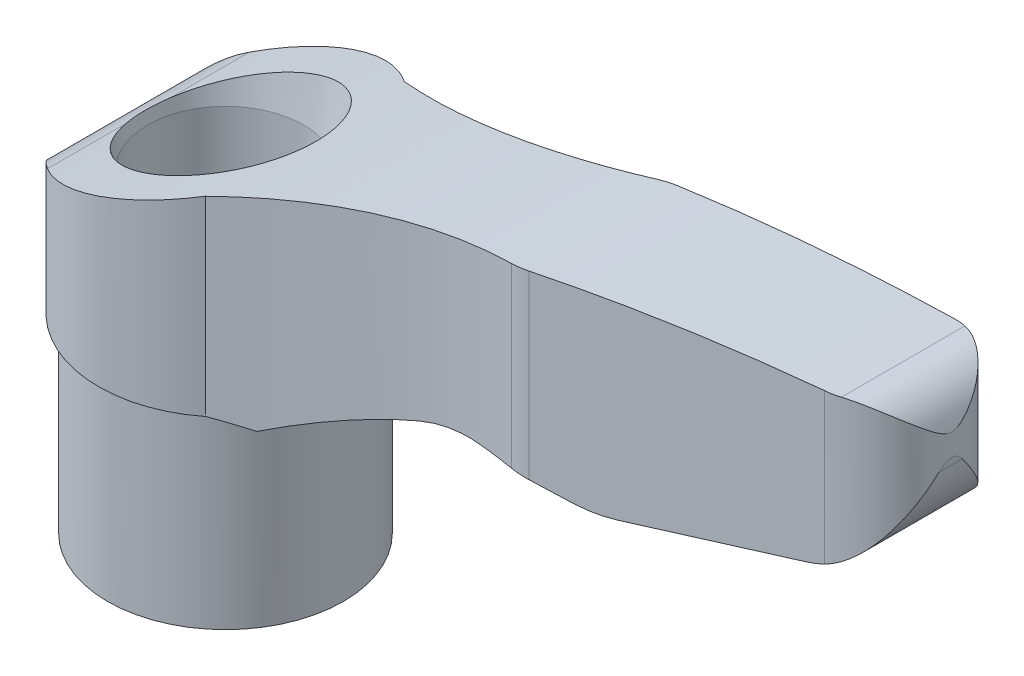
ISO-10303-21;
HEADER;
FILE_DESCRIPTION(('STEP AP214'),'2;1');
FILE_NAME('part.step','',(''),(''),'','','');
FILE_SCHEMA(('AUTOMOTIVE_DESIGN { 1 0 10303 214 1 1 1 1 }'));
ENDSEC;
DATA;
#1=APPLICATION_CONTEXT('core data for automotive mechanical design processes');
#2=APPLICATION_PROTOCOL_DEFINITION('international standard','automotive_design',2000,#1);
#3=PRODUCT_CONTEXT('',#1,'mechanical');
#4=PRODUCT('Part','Part','',(#3));
#5=PRODUCT_RELATED_PRODUCT_CATEGORY('part','',(#4));
#6=PRODUCT_DEFINITION_FORMATION('','',#4);
#7=PRODUCT_DEFINITION_CONTEXT('part definition',#1,'design');
#8=PRODUCT_DEFINITION('design','',#6,#7);
#9=PRODUCT_DEFINITION_SHAPE('','',#8);
#10=(LENGTH_UNIT() NAMED_UNIT(*) SI_UNIT(.MILLI.,.METRE.));
#11=(NAMED_UNIT(*) PLANE_ANGLE_UNIT() SI_UNIT($,.RADIAN.));
#12=(NAMED_UNIT(*) SI_UNIT($,.STERADIAN.) SOLID_ANGLE_UNIT());
#13=UNCERTAINTY_MEASURE_WITH_UNIT(LENGTH_MEASURE(1.E-05),#10,'distance_accuracy_value','');
#14=(GEOMETRIC_REPRESENTATION_CONTEXT(3) GLOBAL_UNCERTAINTY_ASSIGNED_CONTEXT((#13)) GLOBAL_UNIT_ASSIGNED_CONTEXT((#10,
#11,#12)) REPRESENTATION_CONTEXT('',''));
#15=CARTESIAN_POINT('',(0.,0.,0.));
#16=DIRECTION('',(0.,0.,1.));
#17=DIRECTION('',(1.,0.,0.));
#18=AXIS2_PLACEMENT_3D('',#15,#16,#17);
#19=CARTESIAN_POINT('',(-6.51,14.5,8.));
#20=DIRECTION('',(0.,1.,0.));
#21=DIRECTION('',(0.,0.,1.));
#22=AXIS2_PLACEMENT_3D('',#19,#20,#21);
#23=PLANE('',#22);
#24=CARTESIAN_POINT('',(14.8,14.5,-33.6));
#25=DIRECTION('',(0.,1.,0.));
#26=DIRECTION('',(0.,0.,1.));
#27=AXIS2_PLACEMENT_3D('',#24,#25,#26);
#28=CIRCLE('',#27,30.);
#29=CARTESIAN_POINT('',(6.49,14.5,-4.77390244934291));
#30=VERTEX_POINT('',#29);
#31=CARTESIAN_POINT('',(4.3627858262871,14.5,-5.4741300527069));
#32=VERTEX_POINT('',#31);
#33=EDGE_CURVE('E408',#30,#32,#28,.F.);
#34=ORIENTED_EDGE('',*,*,#33,.F.);
#35=DIRECTION('',(0.,0.,-1.));
#36=VECTOR('',#35,1.);
#37=CARTESIAN_POINT('',(6.49,14.5,8.));
#38=LINE('',#37,#36);
#39=CARTESIAN_POINT('',(6.49,14.5,0.));
#40=VERTEX_POINT('',#39);
#41=EDGE_CURVE('E210',#40,#30,#38,.T.);
#42=ORIENTED_EDGE('',*,*,#41,.F.);
#43=CARTESIAN_POINT('',(-0.0099999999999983,14.5,0.));
#44=DIRECTION('',(0.,1.,0.));
#45=DIRECTION('',(0.,0.,1.));
#46=AXIS2_PLACEMENT_3D('',#43,#44,#45);
#47=CIRCLE('',#46,6.5);
#48=CARTESIAN_POINT('',(-6.51,14.5,0.));
#49=VERTEX_POINT('',#48);
#50=EDGE_CURVE('E412',#40,#49,#47,.T.);
#51=ORIENTED_EDGE('',*,*,#50,.T.);
#52=DIRECTION('',(0.,0.,-1.));
#53=VECTOR('',#52,1.);
#54=CARTESIAN_POINT('',(-6.51,14.5,8.));
#55=LINE('',#54,#53);
#56=CARTESIAN_POINT('',(-6.51,14.5,-2.57291663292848));
#57=VERTEX_POINT('',#56);
#58=EDGE_CURVE('E213',#49,#57,#55,.T.);
#59=ORIENTED_EDGE('',*,*,#58,.T.);
#60=CARTESIAN_POINT('',(0.,14.5,0.));
#61=DIRECTION('',(0.,1.,0.));
#62=DIRECTION('',(0.,0.,1.));
#63=AXIS2_PLACEMENT_3D('',#60,#61,#62);
#64=CIRCLE('',#63,7.);
#65=EDGE_CURVE('E456',#32,#57,#64,.T.);
#66=ORIENTED_EDGE('',*,*,#65,.F.);
#67=EDGE_LOOP('',(#34,#42,#51,#59,#66));
#68=FACE_BOUND('',#67,.T.);
#69=ADVANCED_FACE('F14',(#68),#23,.F.);
#70=CARTESIAN_POINT('',(-6.51,18.787325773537,8.));
#71=DIRECTION('',(1.,0.,0.));
#72=DIRECTION('',(0.,0.,-1.));
#73=AXIS2_PLACEMENT_3D('',#70,#71,#72);
#74=PLANE('',#73);
#75=DIRECTION('',(0.,1.,0.));
#76=VECTOR('',#75,1.);
#77=CARTESIAN_POINT('',(-6.51,0.,-2.57291663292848));
#78=LINE('',#77,#76);
#79=CARTESIAN_POINT('',(-6.51,18.787325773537,-2.57291663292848));
#80=VERTEX_POINT('',#79);
#81=EDGE_CURVE('E257',#57,#80,#78,.T.);
#82=ORIENTED_EDGE('',*,*,#81,.F.);
#83=ORIENTED_EDGE('',*,*,#58,.F.);
#84=CARTESIAN_POINT('',(-6.51,14.5,2.57291663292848));
#85=VERTEX_POINT('',#84);
#86=EDGE_CURVE('E214',#85,#49,#55,.T.);
#87=ORIENTED_EDGE('',*,*,#86,.F.);
#88=DIRECTION('',(0.,1.,0.));
#89=VECTOR('',#88,1.);
#90=CARTESIAN_POINT('',(-6.51,0.,2.57291663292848));
#91=LINE('',#90,#89);
#92=CARTESIAN_POINT('',(-6.51,18.787325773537,2.57291663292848));
#93=VERTEX_POINT('',#92);
#94=EDGE_CURVE('E427',#93,#85,#91,.F.);
#95=ORIENTED_EDGE('',*,*,#94,.F.);
#96=DIRECTION('',(0.,0.,-1.));
#97=VECTOR('',#96,1.);
#98=CARTESIAN_POINT('',(-6.51,18.787325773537,8.));
#99=LINE('',#98,#97);
#100=EDGE_CURVE('E189',#93,#80,#99,.T.);
#101=ORIENTED_EDGE('',*,*,#100,.T.);
#102=EDGE_LOOP('',(#82,#83,#87,#95,#101));
#103=FACE_BOUND('',#102,.T.);
#104=ADVANCED_FACE('F16',(#103),#74,.F.);
#105=CARTESIAN_POINT('',(14.8,14.5,33.6));
#106=DIRECTION('',(0.,1.,0.));
#107=DIRECTION('',(0.,0.,1.));
#108=AXIS2_PLACEMENT_3D('',#105,#106,#107);
#109=CIRCLE('',#108,30.);
#110=CARTESIAN_POINT('',(4.3627858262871,14.5,5.4741300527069));
#111=VERTEX_POINT('',#110);
#112=CARTESIAN_POINT('',(6.49,14.5,4.77390244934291));
#113=VERTEX_POINT('',#112);
#114=EDGE_CURVE('E515',#111,#113,#109,.F.);
#115=ORIENTED_EDGE('',*,*,#114,.F.);
#116=CARTESIAN_POINT('',(0.,14.5,0.));
#117=DIRECTION('',(0.,1.,0.));
#118=DIRECTION('',(0.,0.,1.));
#119=AXIS2_PLACEMENT_3D('',#116,#117,#118);
#120=CIRCLE('',#119,7.);
#121=EDGE_CURVE('E457',#85,#111,#120,.T.);
#122=ORIENTED_EDGE('',*,*,#121,.F.);
#123=ORIENTED_EDGE('',*,*,#86,.T.);
#124=EDGE_CURVE('E410',#49,#40,#47,.T.);
#125=ORIENTED_EDGE('',*,*,#124,.T.);
#126=EDGE_CURVE('E211',#113,#40,#38,.T.);
#127=ORIENTED_EDGE('',*,*,#126,.F.);
#128=EDGE_LOOP('',(#115,#122,#123,#125,#127));
#129=FACE_BOUND('',#128,.T.);
#130=ADVANCED_FACE('F463',(#129),#23,.F.);
#131=CARTESIAN_POINT('',(42.8289340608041,-49.9630271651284,8.));
#132=DIRECTION('',(0.,0.,-1.));
#133=DIRECTION('',(-1.,0.,0.));
#134=AXIS2_PLACEMENT_3D('',#131,#132,#133);
#135=CYLINDRICAL_SURFACE('',#134,73.9999999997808);
#136=DIRECTION('',(0.,0.,-1.));
#137=VECTOR('',#136,1.);
#138=CARTESIAN_POINT('',(14.2560355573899,18.2981585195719,8.));
#139=LINE('',#138,#137);
#140=CARTESIAN_POINT('',(14.2560355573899,18.2981585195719,3.60493202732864));
#141=VERTEX_POINT('',#140);
#142=CARTESIAN_POINT('',(14.2560355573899,18.2981585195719,-3.60493202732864));
#143=VERTEX_POINT('',#142);
#144=EDGE_CURVE('E207',#141,#143,#139,.T.);
#145=ORIENTED_EDGE('',*,*,#144,.F.);
#146=CARTESIAN_POINT('',(6.49,14.5,4.77390244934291));
#147=CARTESIAN_POINT('',(7.10709183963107,14.8479114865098,4.59600017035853));
#148=CARTESIAN_POINT('',(7.73340291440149,15.1892512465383,4.43691869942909));
#149=CARTESIAN_POINT('',(8.9999083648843,15.8557045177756,4.15891482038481));
#150=CARTESIAN_POINT('',(9.64003521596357,16.1808788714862,4.03983028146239));
#151=CARTESIAN_POINT('',(10.9347595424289,16.814824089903,3.84283944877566));
#152=CARTESIAN_POINT('',(11.5893580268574,17.1235938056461,3.76493603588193));
#153=CARTESIAN_POINT('',(12.5814258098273,17.5737847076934,3.68029491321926));
#154=CARTESIAN_POINT('',(12.9145226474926,17.7219861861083,3.65743626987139));
#155=CARTESIAN_POINT('',(13.583370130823,18.0136612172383,3.62280963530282));
#156=CARTESIAN_POINT('',(13.9191209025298,18.1571345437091,3.6110421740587));
#157=CARTESIAN_POINT('',(14.2560355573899,18.298158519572,3.60493202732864));
#158=B_SPLINE_CURVE_WITH_KNOTS('',3,(#146,#147,#148,#149,#150,#151,#152,#153,#154,#155,#156,
#157),.UNSPECIFIED.,.F.,.F.,(4,2,2,2,2,4),(0.,2.19098662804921,4.37298159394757,
6.55512918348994,7.6508296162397,8.74658240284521),.UNSPECIFIED.);
#159=EDGE_CURVE('E516',#113,#141,#158,.T.);
#160=ORIENTED_EDGE('',*,*,#159,.F.);
#161=ORIENTED_EDGE('',*,*,#126,.T.);
#162=ORIENTED_EDGE('',*,*,#41,.T.);
#163=CARTESIAN_POINT('',(14.2560355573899,18.2981585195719,-3.60493202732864));
#164=CARTESIAN_POINT('',(13.9191209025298,18.157134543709,-3.6110421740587));
#165=CARTESIAN_POINT('',(13.583370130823,18.0136612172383,-3.62280963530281));
#166=CARTESIAN_POINT('',(12.9145226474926,17.7219861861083,-3.65743626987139));
#167=CARTESIAN_POINT('',(12.5814258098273,17.5737847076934,-3.68029491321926));
#168=CARTESIAN_POINT('',(11.5893580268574,17.1235938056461,-3.76493603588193));
#169=CARTESIAN_POINT('',(10.9347595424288,16.814824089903,-3.84283944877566));
#170=CARTESIAN_POINT('',(9.64003521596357,16.1808788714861,-4.03983028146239));
#171=CARTESIAN_POINT('',(8.9999083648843,15.8557045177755,-4.15891482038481));
#172=CARTESIAN_POINT('',(7.73340291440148,15.1892512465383,-4.43691869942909));
#173=CARTESIAN_POINT('',(7.10709183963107,14.8479114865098,-4.59600017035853));
#174=CARTESIAN_POINT('',(6.49,14.5,-4.77390244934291));
#175=B_SPLINE_CURVE_WITH_KNOTS('',3,(#163,#164,#165,#166,#167,#168,#169,#170,#171,#172,#173,
#174),.UNSPECIFIED.,.F.,.F.,(4,2,2,2,2,4),(0.,1.0957527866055,2.19145321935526,4.37360080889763,
6.55559577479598,8.74658240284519),.UNSPECIFIED.);
#176=EDGE_CURVE('E400',#143,#30,#175,.T.);
#177=ORIENTED_EDGE('',*,*,#176,.F.);
#178=EDGE_LOOP('',(#145,#160,#161,#162,#177));
#179=FACE_BOUND('',#178,.T.);
#180=ADVANCED_FACE('F380',(#179),#135,.F.);
#181=CARTESIAN_POINT('',(17.7504238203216,9.94999999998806,8.));
#182=DIRECTION('',(0.,0.,-1.));
#183=DIRECTION('',(-1.,0.,0.));
#184=AXIS2_PLACEMENT_3D('',#181,#182,#183);
#185=CYLINDRICAL_SURFACE('',#184,9.05000000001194);
#186=CARTESIAN_POINT('',(17.750423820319,19.,-3.74543587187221));
#187=CARTESIAN_POINT('',(17.5046390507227,19.0000347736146,-3.72111558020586));
#188=CARTESIAN_POINT('',(17.2585407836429,18.9899888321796,-3.69988852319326));
#189=CARTESIAN_POINT('',(16.7673975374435,18.9498183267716,-3.66357523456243));
#190=CARTESIAN_POINT('',(16.5223532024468,18.9196828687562,-3.6484923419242));
#191=CARTESIAN_POINT('',(16.0394135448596,18.8400993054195,-3.62465265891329));
#192=CARTESIAN_POINT('',(15.8014675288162,18.7909886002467,-3.61579257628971));
#193=CARTESIAN_POINT('',(15.3302904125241,18.673778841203,-3.60376296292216));
#194=CARTESIAN_POINT('',(15.0970562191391,18.6056927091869,-3.60058957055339));
#195=CARTESIAN_POINT('',(14.7640124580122,18.4937500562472,-3.59984438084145));
#196=CARTESIAN_POINT('',(14.6616681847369,18.4572847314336,-3.60014663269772));
#197=CARTESIAN_POINT('',(14.4579719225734,18.3805483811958,-3.60177627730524));
#198=CARTESIAN_POINT('',(14.3566253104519,18.340263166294,-3.60310763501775));
#199=CARTESIAN_POINT('',(14.2560355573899,18.2981585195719,-3.60493202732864));
#200=B_SPLINE_CURVE_WITH_KNOTS('',3,(#186,#187,#188,#189,#190,#191,#192,#193,#194,#195,#196,
#197,#198,#199),.UNSPECIFIED.,.F.,.F.,(4,2,2,2,2,2,4),(0.,0.7407456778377,1.48189337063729,
2.21042785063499,2.93846742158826,3.26434594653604,3.59148632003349),.UNSPECIFIED.);
#201=CARTESIAN_POINT('',(17.750423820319,19.,-3.74543587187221));
#202=VERTEX_POINT('',#201);
#203=EDGE_CURVE('E393',#202,#143,#200,.T.);
#204=ORIENTED_EDGE('',*,*,#203,.F.);
#205=DIRECTION('',(0.,0.,-1.));
#206=VECTOR('',#205,1.);
#207=CARTESIAN_POINT('',(17.750423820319,19.,8.));
#208=LINE('',#207,#206);
#209=CARTESIAN_POINT('',(17.750423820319,19.,3.74543587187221));
#210=VERTEX_POINT('',#209);
#211=EDGE_CURVE('E204',#210,#202,#208,.T.);
#212=ORIENTED_EDGE('',*,*,#211,.F.);
#213=CARTESIAN_POINT('',(14.2560355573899,18.2981585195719,3.60493202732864));
#214=CARTESIAN_POINT('',(14.483816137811,18.3935396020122,3.60077563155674));
#215=CARTESIAN_POINT('',(14.7155749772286,18.4795580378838,3.59919241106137));
#216=CARTESIAN_POINT('',(15.1854578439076,18.6324166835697,3.60156277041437));
#217=CARTESIAN_POINT('',(15.423585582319,18.6992454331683,3.60551965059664));
#218=CARTESIAN_POINT('',(15.9002362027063,18.8121846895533,3.61924836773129));
#219=CARTESIAN_POINT('',(16.1386829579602,18.8586293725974,3.62891979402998));
#220=CARTESIAN_POINT('',(16.6180975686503,18.9321530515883,3.65418161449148));
#221=CARTESIAN_POINT('',(16.85906355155,18.9592455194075,3.6697678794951));
#222=CARTESIAN_POINT('',(17.2084780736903,18.9844088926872,3.69663888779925));
#223=CARTESIAN_POINT('',(17.316603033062,18.9902441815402,3.70554405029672));
#224=CARTESIAN_POINT('',(17.5333084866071,18.9980471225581,3.72457700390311));
#225=CARTESIAN_POINT('',(17.6418891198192,18.9999996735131,3.73470940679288));
#226=CARTESIAN_POINT('',(17.750423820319,19.,3.74543587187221));
#227=B_SPLINE_CURVE_WITH_KNOTS('',3,(#213,#214,#215,#216,#217,#218,#219,#220,#221,#222,#223,
#224,#225,#226),.UNSPECIFIED.,.F.,.F.,(4,2,2,2,2,2,4),(0.,0.740736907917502,1.48191527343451,
2.21044217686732,2.93846142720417,3.26434207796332,3.59148772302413),.UNSPECIFIED.);
#228=EDGE_CURVE('E385',#141,#210,#227,.T.);
#229=ORIENTED_EDGE('',*,*,#228,.F.);
#230=ORIENTED_EDGE('',*,*,#144,.T.);
#231=EDGE_LOOP('',(#204,#212,#229,#230));
#232=FACE_BOUND('',#231,.T.);
#233=ADVANCED_FACE('F375',(#232),#185,.F.);
#234=CARTESIAN_POINT('',(17.750423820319,19.,8.));
#235=DIRECTION('',(0.,1.,0.));
#236=DIRECTION('',(0.,0.,1.));
#237=AXIS2_PLACEMENT_3D('',#234,#235,#236);
#238=PLANE('',#237);
#239=CARTESIAN_POINT('',(14.8,19.,-33.6));
#240=DIRECTION('',(0.,1.,0.));
#241=DIRECTION('',(0.,0.,1.));
#242=AXIS2_PLACEMENT_3D('',#239,#240,#241);
#243=CIRCLE('',#242,30.);
#244=CARTESIAN_POINT('',(19.776621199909,19.,-4.0156588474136));
#245=VERTEX_POINT('',#244);
#246=EDGE_CURVE('E401',#245,#202,#243,.F.);
#247=ORIENTED_EDGE('',*,*,#246,.F.);
#248=CARTESIAN_POINT('',(20.6060580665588,19.,0.915064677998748));
#249=DIRECTION('',(0.,1.,0.));
#250=DIRECTION('',(0.,0.,1.));
#251=AXIS2_PLACEMENT_3D('',#248,#249,#250);
#252=CIRCLE('',#251,4.99999999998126);
#253=CARTESIAN_POINT('',(20.791020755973,19.,-4.0815130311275));
#254=VERTEX_POINT('',#253);
#255=EDGE_CURVE('E1039',#254,#245,#252,.T.);
#256=ORIENTED_EDGE('',*,*,#255,.F.);
#257=DIRECTION('',(-0.999315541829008,0.,-0.0369925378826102));
#258=VECTOR('',#257,1.);
#259=CARTESIAN_POINT('',(18.2012046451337,19.,-4.17738252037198));
#260=LINE('',#259,#258);
#261=CARTESIAN_POINT('',(23.046668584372,19.,-3.99801374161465));
#262=VERTEX_POINT('',#261);
#263=EDGE_CURVE('E497',#262,#254,#260,.T.);
#264=ORIENTED_EDGE('',*,*,#263,.F.);
#265=DIRECTION('',(0.,0.,-1.));
#266=VECTOR('',#265,1.);
#267=CARTESIAN_POINT('',(23.046668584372,19.,8.));
#268=LINE('',#267,#266);
#269=CARTESIAN_POINT('',(23.046668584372,19.,3.99801374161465));
#270=VERTEX_POINT('',#269);
#271=EDGE_CURVE('E201',#270,#262,#268,.T.);
#272=ORIENTED_EDGE('',*,*,#271,.F.);
#273=DIRECTION('',(0.999315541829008,0.,-0.0369925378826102));
#274=VECTOR('',#273,1.);
#275=CARTESIAN_POINT('',(17.6097291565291,19.,4.19927768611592));
#276=LINE('',#275,#274);
#277=CARTESIAN_POINT('',(20.791020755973,19.,4.0815130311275));
#278=VERTEX_POINT('',#277);
#279=EDGE_CURVE('E503',#278,#270,#276,.T.);
#280=ORIENTED_EDGE('',*,*,#279,.F.);
#281=CARTESIAN_POINT('',(20.6060580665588,19.,-0.915064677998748));
#282=DIRECTION('',(0.,1.,0.));
#283=DIRECTION('',(0.,0.,1.));
#284=AXIS2_PLACEMENT_3D('',#281,#282,#283);
#285=CIRCLE('',#284,4.99999999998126);
#286=CARTESIAN_POINT('',(19.776621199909,19.,4.01565884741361));
#287=VERTEX_POINT('',#286);
#288=EDGE_CURVE('E513',#287,#278,#285,.T.);
#289=ORIENTED_EDGE('',*,*,#288,.F.);
#290=CARTESIAN_POINT('',(14.8,19.,33.6));
#291=DIRECTION('',(0.,1.,0.));
#292=DIRECTION('',(0.,0.,1.));
#293=AXIS2_PLACEMENT_3D('',#290,#291,#292);
#294=CIRCLE('',#293,30.);
#295=EDGE_CURVE('E523',#210,#287,#294,.F.);
#296=ORIENTED_EDGE('',*,*,#295,.F.);
#297=ORIENTED_EDGE('',*,*,#211,.T.);
#298=EDGE_LOOP('',(#247,#256,#264,#272,#280,#289,#296,#297));
#299=FACE_BOUND('',#298,.T.);
#300=ADVANCED_FACE('F371',(#299),#238,.F.);
#301=CARTESIAN_POINT('',(23.0466685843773,28.0499999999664,8.));
#302=DIRECTION('',(0.,0.,-1.));
#303=DIRECTION('',(-1.,0.,0.));
#304=AXIS2_PLACEMENT_3D('',#301,#302,#303);
#305=CYLINDRICAL_SURFACE('',#304,9.04999999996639);
#306=CARTESIAN_POINT('',(23.0466685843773,28.0499999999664,-3.99801374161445));
#307=DIRECTION('',(0.0369925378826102,0.,-0.999315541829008));
#308=DIRECTION('',(-0.999315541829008,0.,-0.0369925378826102));
#309=AXIS2_PLACEMENT_3D('',#306,#307,#308);
#310=ELLIPSE('',#309,9.05619858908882,9.04999999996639);
#311=CARTESIAN_POINT('',(25.51080482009,19.34192715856,-3.90679665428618));
#312=VERTEX_POINT('',#311);
#313=EDGE_CURVE('E1040',#312,#262,#310,.T.);
#314=ORIENTED_EDGE('',*,*,#313,.F.);
#315=DIRECTION('',(0.,0.,-1.));
#316=VECTOR('',#315,1.);
#317=CARTESIAN_POINT('',(25.51080482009,19.34192715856,8.));
#318=LINE('',#317,#316);
#319=CARTESIAN_POINT('',(25.51080482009,19.34192715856,3.90679665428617));
#320=VERTEX_POINT('',#319);
#321=EDGE_CURVE('E198',#320,#312,#318,.T.);
#322=ORIENTED_EDGE('',*,*,#321,.F.);
#323=CARTESIAN_POINT('',(23.0466685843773,28.0499999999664,3.99801374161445));
#324=DIRECTION('',(0.0369925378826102,0.,0.999315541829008));
#325=DIRECTION('',(0.999315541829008,0.,-0.0369925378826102));
#326=AXIS2_PLACEMENT_3D('',#323,#324,#325);
#327=ELLIPSE('',#326,9.05619858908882,9.04999999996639);
#328=EDGE_CURVE('E504',#270,#320,#327,.T.);
#329=ORIENTED_EDGE('',*,*,#328,.F.);
#330=ORIENTED_EDGE('',*,*,#271,.T.);
#331=EDGE_LOOP('',(#314,#322,#329,#330));
#332=FACE_BOUND('',#331,.T.);
#333=ADVANCED_FACE('F367',(#332),#305,.T.);
#334=CARTESIAN_POINT('',(25.51080482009,19.34192715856,8.));
#335=DIRECTION('',(-0.272280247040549,0.962217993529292,0.));
#336=DIRECTION('',(-0.962217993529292,-0.272280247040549,0.));
#337=AXIS2_PLACEMENT_3D('',#334,#335,#336);
#338=PLANE('',#337);
#339=DIRECTION('',(-0.961608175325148,-0.272107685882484,-0.0355966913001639));
#340=VECTOR('',#339,1.);
#341=CARTESIAN_POINT('',(25.918375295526,19.457257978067,-3.8917092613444));
#342=LINE('',#341,#340);
#343=CARTESIAN_POINT('',(35.534460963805,22.178335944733,-3.53574220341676));
#344=VERTEX_POINT('',#343);
#345=EDGE_CURVE('E1044',#344,#312,#342,.T.);
#346=ORIENTED_EDGE('',*,*,#345,.F.);
#347=DIRECTION('',(0.,0.,-1.));
#348=VECTOR('',#347,1.);
#349=CARTESIAN_POINT('',(35.534460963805,22.178335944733,8.));
#350=LINE('',#349,#348);
#351=CARTESIAN_POINT('',(35.534460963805,22.178335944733,3.53574220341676));
#352=VERTEX_POINT('',#351);
#353=EDGE_CURVE('E195',#352,#344,#350,.T.);
#354=ORIENTED_EDGE('',*,*,#353,.F.);
#355=DIRECTION('',(0.961608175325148,0.272107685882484,-0.0355966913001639));
#356=VECTOR('',#355,1.);
#357=CARTESIAN_POINT('',(25.3706941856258,19.3022798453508,3.9119832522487));
#358=LINE('',#357,#356);
#359=EDGE_CURVE('E507',#320,#352,#358,.T.);
#360=ORIENTED_EDGE('',*,*,#359,.F.);
#361=ORIENTED_EDGE('',*,*,#321,.T.);
#362=EDGE_LOOP('',(#346,#354,#360,#361));
#363=FACE_BOUND('',#362,.T.);
#364=ADVANCED_FACE('F362',(#363),#338,.F.);
#365=CARTESIAN_POINT('',(33.8626602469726,28.0863544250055,8.));
#366=DIRECTION('',(0.,0.,-1.));
#367=DIRECTION('',(-1.,0.,0.));
#368=AXIS2_PLACEMENT_3D('',#365,#366,#367);
#369=CYLINDRICAL_SURFACE('',#368,6.14000000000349);
#370=CARTESIAN_POINT('',(33.8626602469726,28.0863544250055,-3.59762871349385));
#371=DIRECTION('',(0.0369925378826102,0.,-0.999315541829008));
#372=DIRECTION('',(-0.999315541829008,0.,-0.0369925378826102));
#373=AXIS2_PLACEMENT_3D('',#370,#371,#372);
#374=ELLIPSE('',#373,6.14420545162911,6.14000000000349);
#375=CARTESIAN_POINT('',(36.5,22.5416236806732,-3.5));
#376=VERTEX_POINT('',#375);
#377=EDGE_CURVE('E1045',#376,#344,#374,.T.);
#378=ORIENTED_EDGE('',*,*,#377,.F.);
#379=CARTESIAN_POINT('',(39.938965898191,27.204249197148,-0.650779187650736));
#380=CARTESIAN_POINT('',(39.924702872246,27.1059853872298,-0.726086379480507));
#381=CARTESIAN_POINT('',(39.9079968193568,27.007686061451,-0.800887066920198));
#382=CARTESIAN_POINT('',(39.8696347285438,26.8112602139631,-0.949458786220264));
#383=CARTESIAN_POINT('',(39.8479781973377,26.7131337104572,-1.02322971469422));
#384=CARTESIAN_POINT('',(39.7995979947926,26.5170899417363,-1.16988012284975));
#385=CARTESIAN_POINT('',(39.7728626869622,26.4191736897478,-1.24275713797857));
#386=CARTESIAN_POINT('',(39.7142815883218,26.2239599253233,-1.38725410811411));
#387=CARTESIAN_POINT('',(39.6824358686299,26.1266624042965,-1.45887408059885));
#388=CARTESIAN_POINT('',(39.5782917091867,25.8337016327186,-1.67318502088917));
#389=CARTESIAN_POINT('',(39.4979263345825,25.6391889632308,-1.81366367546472));
#390=CARTESIAN_POINT('',(39.3150854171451,25.2551202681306,-2.08619457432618));
#391=CARTESIAN_POINT('',(39.2126344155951,25.0655590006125,-2.21825596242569));
#392=CARTESIAN_POINT('',(38.9595027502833,24.6523338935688,-2.49877334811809));
#393=CARTESIAN_POINT('',(38.8031801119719,24.4302018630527,-2.64456339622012));
#394=CARTESIAN_POINT('',(38.5417124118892,24.108275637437,-2.84488994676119));
#395=CARTESIAN_POINT('',(38.4501831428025,24.0029632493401,-2.90854134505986));
#396=CARTESIAN_POINT('',(38.2579442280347,23.7967186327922,-3.02861213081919));
#397=CARTESIAN_POINT('',(38.1572360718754,23.6957856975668,-3.08503268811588));
#398=CARTESIAN_POINT('',(37.8892625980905,23.4457323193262,-3.21757634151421));
#399=CARTESIAN_POINT('',(37.7155213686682,23.3001643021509,-3.28779061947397));
#400=CARTESIAN_POINT('',(37.4396992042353,23.0946053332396,-3.37286339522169));
#401=CARTESIAN_POINT('',(37.3453175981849,23.0282732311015,-3.39783246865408));
#402=CARTESIAN_POINT('',(37.1517842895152,22.9003457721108,-3.44019984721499));
#403=CARTESIAN_POINT('',(37.0526354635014,22.8387476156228,-3.45760265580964));
#404=CARTESIAN_POINT('',(36.8781783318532,22.7372021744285,-3.48029211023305));
#405=CARTESIAN_POINT('',(36.8038676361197,22.6959814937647,-3.48759914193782));
#406=CARTESIAN_POINT('',(36.6533047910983,22.6165121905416,-3.49745586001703));
#407=CARTESIAN_POINT('',(36.5770513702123,22.57826558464,-3.50000234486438));
#408=CARTESIAN_POINT('',(36.5,22.5416236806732,-3.5));
#409=B_SPLINE_CURVE_WITH_KNOTS('',3,(#379,#380,#381,#382,#383,#384,#385,#386,#387,#388,#389,
#390,#391,#392,#393,#394,#395,#396,#397,#398,#399,#400,#401,#402,#403,#404,#405,#406,#407,#408),
.UNSPECIFIED.,.F.,.F.,(4,2,2,2,2,2,2,2,2,2,2,2,2,2,4),(0.,0.373839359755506,0.747715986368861,
1.1224598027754,1.49719840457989,2.25512351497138,3.01221072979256,3.93367725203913,
4.39332639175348,4.85290107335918,5.56171222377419,5.91546495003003,6.26900683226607,
6.52468766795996,6.78054039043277),.UNSPECIFIED.);
#410=CARTESIAN_POINT('',(39.938965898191,27.204249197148,-0.650779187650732));
#411=VERTEX_POINT('',#410);
#412=EDGE_CURVE('E350',#411,#376,#409,.T.);
#413=ORIENTED_EDGE('',*,*,#412,.F.);
#414=DIRECTION('',(0.,0.,-1.));
#415=VECTOR('',#414,1.);
#416=CARTESIAN_POINT('',(39.938965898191,27.204249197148,8.));
#417=LINE('',#416,#415);
#418=CARTESIAN_POINT('',(39.938965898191,27.204249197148,0.650779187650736));
#419=VERTEX_POINT('',#418);
#420=EDGE_CURVE('E187',#419,#411,#417,.T.);
#421=ORIENTED_EDGE('',*,*,#420,.F.);
#422=CARTESIAN_POINT('',(36.5,22.5416236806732,3.5));
#423=CARTESIAN_POINT('',(36.6061539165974,22.5920863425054,3.50000941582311));
#424=CARTESIAN_POINT('',(36.7107657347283,22.6456099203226,3.49517280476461));
#425=CARTESIAN_POINT('',(36.9160027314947,22.7581011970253,3.47671082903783));
#426=CARTESIAN_POINT('',(37.016634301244,22.8170596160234,3.46310021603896));
#427=CARTESIAN_POINT('',(37.212347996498,22.9392782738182,3.42816986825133));
#428=CARTESIAN_POINT('',(37.3074768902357,23.0024874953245,3.40693163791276));
#429=CARTESIAN_POINT('',(37.4929223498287,23.1332068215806,3.35757592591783));
#430=CARTESIAN_POINT('',(37.5832363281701,23.2007191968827,3.32945478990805));
#431=CARTESIAN_POINT('',(37.7830795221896,23.3587409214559,3.2585052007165));
#432=CARTESIAN_POINT('',(37.8909927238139,23.4504360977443,3.21376078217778));
#433=CARTESIAN_POINT('',(38.0982482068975,23.6389903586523,3.11588681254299));
#434=CARTESIAN_POINT('',(38.1975840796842,23.7358532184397,3.06275107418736));
#435=CARTESIAN_POINT('',(38.3880468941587,23.934309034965,2.94917464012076));
#436=CARTESIAN_POINT('',(38.4791322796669,24.035922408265,2.88870020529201));
#437=CARTESIAN_POINT('',(38.6526412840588,24.2426721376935,2.761826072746));
#438=CARTESIAN_POINT('',(38.7350674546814,24.3478074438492,2.69542813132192));
#439=CARTESIAN_POINT('',(38.9229341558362,24.6038856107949,2.52996933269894));
#440=CARTESIAN_POINT('',(39.0243159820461,24.7562617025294,2.42850340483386));
#441=CARTESIAN_POINT('',(39.2111706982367,25.0654781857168,2.21796613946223));
#442=CARTESIAN_POINT('',(39.2966363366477,25.2223205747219,2.10889136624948));
#443=CARTESIAN_POINT('',(39.4522229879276,25.5392893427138,1.88493092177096));
#444=CARTESIAN_POINT('',(39.5223498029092,25.6994144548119,1.77004746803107));
#445=CARTESIAN_POINT('',(39.6478320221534,26.0220530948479,1.53583460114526));
#446=CARTESIAN_POINT('',(39.7031929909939,26.1845656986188,1.41650688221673));
#447=CARTESIAN_POINT('',(39.7933776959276,26.4900634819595,1.19018579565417));
#448=CARTESIAN_POINT('',(39.8299343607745,26.6328455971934,1.08360162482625));
#449=CARTESIAN_POINT('',(39.8923391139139,26.9185049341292,0.868586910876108));
#450=CARTESIAN_POINT('',(39.9182264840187,27.0613798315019,0.760164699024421));
#451=CARTESIAN_POINT('',(39.938965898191,27.204249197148,0.650779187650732));
#452=B_SPLINE_CURVE_WITH_KNOTS('',3,(#422,#423,#424,#425,#426,#427,#428,#429,#430,#431,#432,
#433,#434,#435,#436,#437,#438,#439,#440,#441,#442,#443,#444,#445,#446,#447,#448,#449,#450,#451),
.UNSPECIFIED.,.F.,.F.,(4,2,2,2,2,2,2,2,2,2,2,2,2,2,4),(0.,0.352350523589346,0.704110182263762,
1.05221781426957,1.40051067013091,1.84538152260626,2.29058194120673,2.73791274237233,
3.18511134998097,3.81198117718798,4.43913591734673,5.06605301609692,5.69273352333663,
6.23807905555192,6.78139842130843),.UNSPECIFIED.);
#453=CARTESIAN_POINT('',(36.5,22.5416236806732,3.5));
#454=VERTEX_POINT('',#453);
#455=EDGE_CURVE('E344',#454,#419,#452,.T.);
#456=ORIENTED_EDGE('',*,*,#455,.F.);
#457=CARTESIAN_POINT('',(33.8626602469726,28.0863544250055,3.59762871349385));
#458=DIRECTION('',(0.0369925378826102,0.,0.999315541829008));
#459=DIRECTION('',(0.999315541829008,0.,-0.0369925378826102));
#460=AXIS2_PLACEMENT_3D('',#457,#458,#459);
#461=ELLIPSE('',#460,6.14420545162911,6.14000000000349);
#462=EDGE_CURVE('E511',#352,#454,#461,.T.);
#463=ORIENTED_EDGE('',*,*,#462,.F.);
#464=ORIENTED_EDGE('',*,*,#353,.T.);
#465=EDGE_LOOP('',(#378,#413,#421,#456,#463,#464));
#466=FACE_BOUND('',#465,.T.);
#467=ADVANCED_FACE('F357',(#466),#369,.T.);
#468=CARTESIAN_POINT('',(39.938965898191,27.204249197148,8.));
#469=DIRECTION('',(-0.989626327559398,0.143665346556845,0.));
#470=DIRECTION('',(-0.143665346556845,-0.989626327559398,0.));
#471=AXIS2_PLACEMENT_3D('',#468,#469,#470);
#472=PLANE('',#471);
#473=CARTESIAN_POINT('',(36.5,3.51522972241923,0.));
#474=DIRECTION('',(-0.989626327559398,0.143665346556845,0.));
#475=DIRECTION('',(0.143665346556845,0.989626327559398,0.));
#476=AXIS2_PLACEMENT_3D('',#473,#474,#475);
#477=ELLIPSE('',#476,24.3621728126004,3.5);
#478=EDGE_CURVE('E351',#419,#411,#477,.T.);
#479=ORIENTED_EDGE('',*,*,#478,.F.);
#480=ORIENTED_EDGE('',*,*,#420,.T.);
#481=EDGE_LOOP('',(#479,#480));
#482=FACE_BOUND('',#481,.T.);
#483=ADVANCED_FACE('F361',(#482),#472,.F.);
#484=CARTESIAN_POINT('',(37.4659985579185,28.2670414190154,8.));
#485=DIRECTION('',(0.,0.,-1.));
#486=DIRECTION('',(-1.,0.,0.));
#487=AXIS2_PLACEMENT_3D('',#484,#485,#486);
#488=CYLINDRICAL_SURFACE('',#487,2.60000000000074);
#489=CARTESIAN_POINT('',(37.324018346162,30.863161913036,-3.40161634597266));
#490=CARTESIAN_POINT('',(37.3919714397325,30.8668921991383,-3.38517327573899));
#491=CARTESIAN_POINT('',(37.4595366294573,30.8678982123,-3.36663320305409));
#492=CARTESIAN_POINT('',(37.5932555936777,30.8647814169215,-3.32560440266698));
#493=CARTESIAN_POINT('',(37.6594109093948,30.8606645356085,-3.30312026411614));
#494=CARTESIAN_POINT('',(37.789242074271,30.8476880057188,-3.25463078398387));
#495=CARTESIAN_POINT('',(37.8529349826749,30.8388717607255,-3.2286592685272));
#496=CARTESIAN_POINT('',(37.9780608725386,30.8169101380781,-3.17332967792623));
#497=CARTESIAN_POINT('',(38.0394932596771,30.8037636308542,-3.14397072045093));
#498=CARTESIAN_POINT('',(38.2193405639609,30.7585650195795,-3.0515477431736));
#499=CARTESIAN_POINT('',(38.3339861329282,30.7206782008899,-2.98387991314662));
#500=CARTESIAN_POINT('',(38.5517467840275,30.632420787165,-2.83858348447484));
#501=CARTESIAN_POINT('',(38.654834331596,30.5820212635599,-2.76093200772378));
#502=CARTESIAN_POINT('',(38.8266237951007,30.4842690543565,-2.61655584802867));
#503=CARTESIAN_POINT('',(38.897792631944,30.438863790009,-2.55140368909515));
#504=CARTESIAN_POINT('',(39.0330318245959,30.3433991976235,-2.41719472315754));
#505=CARTESIAN_POINT('',(39.0970985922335,30.2933375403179,-2.34813596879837));
#506=CARTESIAN_POINT('',(39.2184581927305,30.1893556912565,-2.2065161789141));
#507=CARTESIAN_POINT('',(39.2757265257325,30.135422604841,-2.13394372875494));
#508=CARTESIAN_POINT('',(39.3834200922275,30.0247265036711,-1.98601495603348));
#509=CARTESIAN_POINT('',(39.4338475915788,29.9679644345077,-1.91065956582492));
#510=CARTESIAN_POINT('',(39.5424214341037,29.8348143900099,-1.73419420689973));
#511=CARTESIAN_POINT('',(39.5982635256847,29.7576996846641,-1.63221056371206));
#512=CARTESIAN_POINT('',(39.6992505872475,29.6016727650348,-1.42414609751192));
#513=CARTESIAN_POINT('',(39.7443776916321,29.5227577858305,-1.31805876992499));
#514=CARTESIAN_POINT('',(39.823974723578,29.3659397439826,-1.10201279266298));
#515=CARTESIAN_POINT('',(39.8584944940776,29.2880336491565,-0.99207503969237));
#516=CARTESIAN_POINT('',(39.9024720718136,29.17546551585,-0.822533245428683));
#517=CARTESIAN_POINT('',(39.9158188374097,29.1387021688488,-0.765322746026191));
#518=CARTESIAN_POINT('',(39.9398686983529,29.0678855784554,-0.648731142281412));
#519=CARTESIAN_POINT('',(39.9505741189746,29.033829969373,-0.589352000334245));
#520=CARTESIAN_POINT('',(39.9677206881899,28.975671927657,-0.477086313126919));
#521=CARTESIAN_POINT('',(39.9745675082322,28.9508463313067,-0.424644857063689));
#522=CARTESIAN_POINT('',(39.9860225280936,28.9073412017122,-0.317100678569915));
#523=CARTESIAN_POINT('',(39.9906385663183,28.888640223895,-0.262008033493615));
#524=CARTESIAN_POINT('',(39.9966232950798,28.8637621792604,-0.160247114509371));
#525=CARTESIAN_POINT('',(39.9984523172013,28.8558445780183,-0.114054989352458));
#526=CARTESIAN_POINT('',(40.0002450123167,28.8480882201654,-0.0209847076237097));
#527=CARTESIAN_POINT('',(40.0002117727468,28.8482360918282,0.0258921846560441));
#528=CARTESIAN_POINT('',(39.9982952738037,28.8565205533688,0.118672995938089));
#529=CARTESIAN_POINT('',(39.9964185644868,28.8646288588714,0.164579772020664));
#530=CARTESIAN_POINT('',(39.9910078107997,28.8870889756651,0.254792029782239));
#531=CARTESIAN_POINT('',(39.9874686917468,28.9014598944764,0.299092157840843));
#532=CARTESIAN_POINT('',(39.9768286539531,28.9425912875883,0.40733139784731));
#533=CARTESIAN_POINT('',(39.9688318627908,28.9719647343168,0.470155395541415));
#534=CARTESIAN_POINT('',(39.9499914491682,29.0357410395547,0.592804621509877));
#535=CARTESIAN_POINT('',(39.9391403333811,29.0701570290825,0.652621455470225));
#536=CARTESIAN_POINT('',(39.9146680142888,29.1419527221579,0.770512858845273));
#537=CARTESIAN_POINT('',(39.9010255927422,29.1793537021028,0.828569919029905));
#538=CARTESIAN_POINT('',(39.8711029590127,29.2555520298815,0.942947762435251));
#539=CARTESIAN_POINT('',(39.8548256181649,29.2943478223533,0.999270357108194));
#540=CARTESIAN_POINT('',(39.8016739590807,29.4125134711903,1.16742991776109));
#541=CARTESIAN_POINT('',(39.760726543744,29.4929030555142,1.27728939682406));
#542=CARTESIAN_POINT('',(39.6677865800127,29.65295004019,1.49294867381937));
#543=CARTESIAN_POINT('',(39.6157834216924,29.7326066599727,1.59874445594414));
#544=CARTESIAN_POINT('',(39.5005966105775,29.8886982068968,1.80564912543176));
#545=CARTESIAN_POINT('',(39.4374685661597,29.9651469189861,1.90677830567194));
#546=CARTESIAN_POINT('',(39.2994325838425,30.1133265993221,2.10420227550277));
#547=CARTESIAN_POINT('',(39.2245348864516,30.1850615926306,2.20050117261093));
#548=CARTESIAN_POINT('',(39.0442952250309,30.3372677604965,2.40820732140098));
#549=CARTESIAN_POINT('',(38.9358891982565,30.4161164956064,2.51819093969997));
#550=CARTESIAN_POINT('',(38.7000552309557,30.5596629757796,2.72661786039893));
#551=CARTESIAN_POINT('',(38.57264006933,30.624370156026,2.82506883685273));
#552=CARTESIAN_POINT('',(38.3254291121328,30.7237895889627,2.98922527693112));
#553=CARTESIAN_POINT('',(38.2087731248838,30.7618633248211,3.05759969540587));
#554=CARTESIAN_POINT('',(37.9650872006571,30.8217517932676,3.18151973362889));
#555=CARTESIAN_POINT('',(37.8380870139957,30.8436114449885,3.23710049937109));
#556=CARTESIAN_POINT('',(37.6449762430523,30.8616374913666,3.30809557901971));
#557=CARTESIAN_POINT('',(37.581615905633,30.8652564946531,3.32934954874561));
#558=CARTESIAN_POINT('',(37.4536360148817,30.8678010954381,3.3682432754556));
#559=CARTESIAN_POINT('',(37.3890152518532,30.866721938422,3.38587935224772));
#560=CARTESIAN_POINT('',(37.324018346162,30.863161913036,3.40161634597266));
#561=B_SPLINE_CURVE_WITH_KNOTS('',3,(#489,#490,#491,#492,#493,#494,#495,#496,#497,#498,#499,
#500,#501,#502,#503,#504,#505,#506,#507,#508,#509,#510,#511,#512,#513,#514,#515,#516,#517,#518,
#519,#520,#521,#522,#523,#524,#525,#526,#527,#528,#529,#530,#531,#532,#533,#534,#535,#536,#537,
#538,#539,#540,#541,#542,#543,#544,#545,#546,#547,#548,#549,#550,#551,#552,#553,#554,#555,#556,
#557,#558,#559,#560),.UNSPECIFIED.,.F.,.F.,(4,2,2,2,2,2,2,2,2,2,2,2,2,2,2,2,2,2,2,2,2,2,2,2,2,2,
2,2,2,2,2,2,2,2,2,4),(0.,0.209913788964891,0.419584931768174,0.627352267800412,
0.835173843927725,1.24864928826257,1.66308971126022,1.98257890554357,2.30222878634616,
2.62299771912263,2.94366014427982,3.36167065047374,3.78037330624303,4.19707731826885,
4.40489951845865,4.61253810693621,4.78756393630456,4.96197021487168,5.10204921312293,
5.24189598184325,5.38124764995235,5.52102749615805,5.72989301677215,5.93931243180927,
6.15038720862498,6.36123350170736,6.78715763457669,7.21349237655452,7.63775356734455,
8.06164764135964,8.58013018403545,9.09826573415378,9.51811060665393,9.93678796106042,
10.1373304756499,10.3380759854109),.UNSPECIFIED.);
#562=CARTESIAN_POINT('',(37.324018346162,30.863161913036,-3.40161634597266));
#563=VERTEX_POINT('',#562);
#564=CARTESIAN_POINT('',(37.324018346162,30.863161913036,3.40161634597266));
#565=VERTEX_POINT('',#564);
#566=EDGE_CURVE('E336',#563,#565,#561,.T.);
#567=ORIENTED_EDGE('',*,*,#566,.F.);
#568=DIRECTION('',(0.,0.,-1.));
#569=VECTOR('',#568,1.);
#570=CARTESIAN_POINT('',(37.324018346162,30.863161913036,8.));
#571=LINE('',#570,#569);
#572=EDGE_CURVE('E184',#565,#563,#571,.T.);
#573=ORIENTED_EDGE('',*,*,#572,.F.);
#574=EDGE_LOOP('',(#567,#573));
#575=FACE_BOUND('',#574,.T.);
#576=ADVANCED_FACE('F265',(#575),#488,.T.);
#577=CARTESIAN_POINT('',(44.8871950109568,-107.430179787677,8.));
#578=DIRECTION('',(0.,0.,-1.));
#579=DIRECTION('',(-1.,0.,0.));
#580=AXIS2_PLACEMENT_3D('',#577,#578,#579);
#581=CYLINDRICAL_SURFACE('',#580,138.500000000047);
#582=DIRECTION('',(0.,0.,-1.));
#583=VECTOR('',#582,1.);
#584=CARTESIAN_POINT('',(-4.25177912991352,22.059631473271,8.));
#585=LINE('',#584,#583);
#586=CARTESIAN_POINT('',(-4.25177912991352,22.059631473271,-1.23277461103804));
#587=VERTEX_POINT('',#586);
#588=CARTESIAN_POINT('',(-4.25177912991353,22.059631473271,-5.56078899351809));
#589=VERTEX_POINT('',#588);
#590=EDGE_CURVE('E174',#587,#589,#585,.T.);
#591=ORIENTED_EDGE('',*,*,#590,.F.);
#592=CARTESIAN_POINT('',(-4.25197912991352,22.0595555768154,-1.23203652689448));
#593=CARTESIAN_POINT('',(-4.2181694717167,22.07238478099,-1.35691255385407));
#594=CARTESIAN_POINT('',(-4.17923896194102,22.0871440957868,-1.4801873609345));
#595=CARTESIAN_POINT('',(-4.09160168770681,22.1203112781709,-1.72266104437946));
#596=CARTESIAN_POINT('',(-4.04289814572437,22.1387179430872,-1.84186124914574));
#597=CARTESIAN_POINT('',(-3.93631405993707,22.178917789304,-2.07505280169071));
#598=CARTESIAN_POINT('',(-3.87846087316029,22.2007008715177,-2.18905841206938));
#599=CARTESIAN_POINT('',(-3.75400318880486,22.2474522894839,-2.41150593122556));
#600=CARTESIAN_POINT('',(-3.68739816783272,22.2724208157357,-2.51994750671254));
#601=CARTESIAN_POINT('',(-3.54608413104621,22.3252561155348,-2.73048562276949));
#602=CARTESIAN_POINT('',(-3.47138443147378,22.3531195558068,-2.83258924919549));
#603=CARTESIAN_POINT('',(-3.31442400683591,22.411496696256,-3.03002014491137));
#604=CARTESIAN_POINT('',(-3.23216057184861,22.4420113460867,-3.12534496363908));
#605=CARTESIAN_POINT('',(-2.97491584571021,22.5371302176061,-3.40037793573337));
#606=CARTESIAN_POINT('',(-2.78942343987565,22.6053306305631,-3.56922851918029));
#607=CARTESIAN_POINT('',(-2.38557696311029,22.7527053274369,-3.88225077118));
#608=CARTESIAN_POINT('',(-2.16600887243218,22.8322677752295,-4.02466125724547));
#609=CARTESIAN_POINT('',(-1.70791993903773,22.996828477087,-4.27061787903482));
#610=CARTESIAN_POINT('',(-1.4693941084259,23.0818281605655,-4.37415374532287));
#611=CARTESIAN_POINT('',(-0.96640981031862,23.2594208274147,-4.54480036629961));
#612=CARTESIAN_POINT('',(-0.701246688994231,23.3521768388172,-4.60966846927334));
#613=CARTESIAN_POINT('',(-0.163875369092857,23.5382589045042,-4.6926028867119));
#614=CARTESIAN_POINT('',(0.108333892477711,23.6315850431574,-4.71066209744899));
#615=CARTESIAN_POINT('',(0.659005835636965,23.8184536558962,-4.69919155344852));
#616=CARTESIAN_POINT('',(0.937462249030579,23.9119478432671,-4.66851241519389));
#617=CARTESIAN_POINT('',(1.48598368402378,24.0942225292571,-4.5576593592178));
#618=CARTESIAN_POINT('',(1.75604875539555,24.183003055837,-4.47748573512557));
#619=CARTESIAN_POINT('',(2.27599070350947,24.3522510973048,-4.27046021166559));
#620=CARTESIAN_POINT('',(2.5260866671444,24.4328127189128,-4.14423716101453));
#621=CARTESIAN_POINT('',(3.00180841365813,24.5846935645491,-3.8477378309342));
#622=CARTESIAN_POINT('',(3.22743953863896,24.6560148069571,-3.67747119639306));
#623=CARTESIAN_POINT('',(3.63795980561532,24.7847783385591,-3.30478047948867));
#624=CARTESIAN_POINT('',(3.82410742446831,24.8426580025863,-3.10389468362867));
#625=CARTESIAN_POINT('',(4.15985941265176,24.946423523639,-2.67089420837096));
#626=CARTESIAN_POINT('',(4.30947394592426,24.9923127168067,-2.43878824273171));
#627=CARTESIAN_POINT('',(4.56064578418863,25.0690125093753,-1.9613667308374));
#628=CARTESIAN_POINT('',(4.6640802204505,25.1004142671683,-1.71713300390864));
#629=CARTESIAN_POINT('',(4.82873183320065,25.1502750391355,-1.2135820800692));
#630=CARTESIAN_POINT('',(4.88995827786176,25.168736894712,-0.954268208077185));
#631=CARTESIAN_POINT('',(4.96659448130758,25.1918289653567,-0.43726116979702));
#632=CARTESIAN_POINT('',(4.98346767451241,25.1969010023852,-0.179803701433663));
#633=CARTESIAN_POINT('',(4.97503743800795,25.1943643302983,0.334342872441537));
#634=CARTESIAN_POINT('',(4.94973823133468,25.1867568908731,0.5910320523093));
#635=CARTESIAN_POINT('',(4.85842095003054,25.1592219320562,1.09322780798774));
#636=CARTESIAN_POINT('',(4.79288432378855,25.1394400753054,1.33883027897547));
#637=CARTESIAN_POINT('',(4.62377703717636,25.0881771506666,1.81525308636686));
#638=CARTESIAN_POINT('',(4.52020543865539,25.0566957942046,2.04607305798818));
#639=CARTESIAN_POINT('',(4.27701852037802,24.9823568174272,2.48949041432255));
#640=CARTESIAN_POINT('',(4.13698934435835,24.9393684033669,2.70183854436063));
#641=CARTESIAN_POINT('',(3.82600829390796,24.8432316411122,3.09989056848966));
#642=CARTESIAN_POINT('',(3.65505253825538,24.7900820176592,3.28559111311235));
#643=CARTESIAN_POINT('',(3.28149563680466,24.6730193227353,3.63154966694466));
#644=CARTESIAN_POINT('',(3.07805854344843,24.6088168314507,3.79080632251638));
#645=CARTESIAN_POINT('',(2.64980837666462,24.4724496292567,4.07300034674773));
#646=CARTESIAN_POINT('',(2.42499093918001,24.4002832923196,4.19593027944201));
#647=CARTESIAN_POINT('',(1.9500789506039,24.2463897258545,4.40765256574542));
#648=CARTESIAN_POINT('',(1.69931065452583,24.1643833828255,4.49473043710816));
#649=CARTESIAN_POINT('',(1.18823369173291,23.995552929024,4.62532603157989));
#650=CARTESIAN_POINT('',(0.927923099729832,23.908727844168,4.66883491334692));
#651=CARTESIAN_POINT('',(0.393872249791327,23.7287956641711,4.71265755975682));
#652=CARTESIAN_POINT('',(0.120018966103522,23.63557696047,4.71112713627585));
#653=CARTESIAN_POINT('',(-0.423330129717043,23.4487288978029,4.66056382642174));
#654=CARTESIAN_POINT('',(-0.692825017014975,23.3550994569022,4.61152098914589));
#655=CARTESIAN_POINT('',(-1.0906613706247,23.2155520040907,4.50259636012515));
#656=CARTESIAN_POINT('',(-1.22355986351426,23.1687008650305,4.45975404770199));
#657=CARTESIAN_POINT('',(-1.48530002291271,23.075992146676,4.36227757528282));
#658=CARTESIAN_POINT('',(-1.61414320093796,23.0301341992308,4.3076478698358));
#659=CARTESIAN_POINT('',(-1.86687568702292,22.9397742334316,4.18686427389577));
#660=CARTESIAN_POINT('',(-1.99076275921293,22.8952728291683,4.12070525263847));
#661=CARTESIAN_POINT('',(-2.23252236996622,22.8080585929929,3.97727506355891));
#662=CARTESIAN_POINT('',(-2.3503974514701,22.7653450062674,3.90000864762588));
#663=CARTESIAN_POINT('',(-2.57752422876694,22.6827128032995,3.73601452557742));
#664=CARTESIAN_POINT('',(-2.6868780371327,22.6427620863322,3.64944447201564));
#665=CARTESIAN_POINT('',(-2.89790863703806,22.5653835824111,3.46647422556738));
#666=CARTESIAN_POINT('',(-2.99958882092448,22.5279546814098,3.37007842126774));
#667=CARTESIAN_POINT('',(-3.19438453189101,22.4560107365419,3.16806014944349));
#668=CARTESIAN_POINT('',(-3.28750319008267,22.4214946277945,3.06244108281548));
#669=CARTESIAN_POINT('',(-3.46429347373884,22.3557688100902,2.84269464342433));
#670=CARTESIAN_POINT('',(-3.54796989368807,22.3245574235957,2.72857163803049));
#671=CARTESIAN_POINT('',(-3.69604800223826,22.2691803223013,2.50615536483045));
#672=CARTESIAN_POINT('',(-3.76155965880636,22.244617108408,2.39869819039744));
#673=CARTESIAN_POINT('',(-3.88400215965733,22.198615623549,2.1783774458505));
#674=CARTESIAN_POINT('',(-3.94093439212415,22.1771768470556,2.06551475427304));
#675=CARTESIAN_POINT('',(-4.0458408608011,22.1376062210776,1.83480859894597));
#676=CARTESIAN_POINT('',(-4.09379369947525,22.1194822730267,1.71695403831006));
#677=CARTESIAN_POINT('',(-4.1801598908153,22.0867949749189,1.47726731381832));
#678=CARTESIAN_POINT('',(-4.2185692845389,22.0722331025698,1.35543352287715));
#679=CARTESIAN_POINT('',(-4.25197912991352,22.0595555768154,1.23203652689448));
#680=B_SPLINE_CURVE_WITH_KNOTS('',3,(#592,#593,#594,#595,#596,#597,#598,#599,#600,#601,#602,
#603,#604,#605,#606,#607,#608,#609,#610,#611,#612,#613,#614,#615,#616,#617,#618,#619,#620,#621,
#622,#623,#624,#625,#626,#627,#628,#629,#630,#631,#632,#633,#634,#635,#636,#637,#638,#639,#640,
#641,#642,#643,#644,#645,#646,#647,#648,#649,#650,#651,#652,#653,#654,#655,#656,#657,#658,#659,
#660,#661,#662,#663,#664,#665,#666,#667,#668,#669,#670,#671,#672,#673,#674,#675,#676,#677,#678,
#679),.UNSPECIFIED.,.F.,.F.,(4,2,2,2,2,2,2,2,2,2,2,2,2,2,2,2,2,2,2,2,2,2,2,2,2,2,2,2,2,2,2,2,2,
2,2,2,2,2,2,2,2,2,2,4),(0.,0.389873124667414,0.779617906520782,1.16821866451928,
1.55684267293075,1.94502406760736,2.33334508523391,3.10968026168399,3.92677568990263,
4.74408681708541,5.60508215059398,6.4662081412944,7.34794510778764,8.22967684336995,
9.09979274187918,9.96971825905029,10.8052357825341,11.6405205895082,12.4377934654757,
13.234891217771,14.0053380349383,14.7757077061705,15.5370346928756,16.2983804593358,
17.0687772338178,17.8392707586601,18.6343588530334,19.4296095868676,20.2593984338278,
21.0893556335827,21.9533419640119,22.8175092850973,23.2589216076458,23.7001674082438,
24.1416100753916,24.5828644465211,25.0175619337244,25.452066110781,25.8864107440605,
26.3205338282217,26.7047915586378,27.0889870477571,27.474086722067,27.8593458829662),.UNSPECIFIED.);
#681=CARTESIAN_POINT('',(-4.25177912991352,22.059631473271,1.23277461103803));
#682=VERTEX_POINT('',#681);
#683=EDGE_CURVE('E34',#587,#682,#680,.T.);
#684=ORIENTED_EDGE('',*,*,#683,.T.);
#685=CARTESIAN_POINT('',(-4.25177912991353,22.059631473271,5.56078899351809));
#686=VERTEX_POINT('',#685);
#687=EDGE_CURVE('E172',#686,#682,#585,.T.);
#688=ORIENTED_EDGE('',*,*,#687,.F.);
#689=CARTESIAN_POINT('',(4.3627858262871,25.0085693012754,5.4741300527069));
#690=CARTESIAN_POINT('',(4.20277495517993,24.9596112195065,5.60168411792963));
#691=CARTESIAN_POINT('',(4.03752498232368,24.9087270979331,5.72188510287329));
#692=CARTESIAN_POINT('',(3.6980104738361,24.8034484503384,5.94694051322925));
#693=CARTESIAN_POINT('',(3.52374852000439,24.749054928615,6.05179930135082));
#694=CARTESIAN_POINT('',(3.16796741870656,24.6371924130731,6.24539297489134));
#695=CARTESIAN_POINT('',(2.98646484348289,24.5797303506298,6.33416236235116));
#696=CARTESIAN_POINT('',(2.61724965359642,24.4619702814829,6.49542780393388));
#697=CARTESIAN_POINT('',(2.4295367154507,24.4016721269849,6.56792300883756));
#698=CARTESIAN_POINT('',(2.0494898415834,24.2786690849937,6.69625133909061));
#699=CARTESIAN_POINT('',(1.85716046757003,24.2159665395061,6.75210023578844));
#700=CARTESIAN_POINT('',(1.46901379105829,24.0884625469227,6.84703814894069));
#701=CARTESIAN_POINT('',(1.27319523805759,24.0236603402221,6.88612102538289));
#702=CARTESIAN_POINT('',(0.879471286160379,23.8923747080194,6.94738998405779));
#703=CARTESIAN_POINT('',(0.681565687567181,23.8258911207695,6.96957443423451));
#704=CARTESIAN_POINT('',(0.284939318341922,23.6916438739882,6.99702386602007));
#705=CARTESIAN_POINT('',(0.0862182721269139,23.6238797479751,7.00228255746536));
#706=CARTESIAN_POINT('',(-0.31704014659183,23.4853426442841,6.99581594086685));
#707=CARTESIAN_POINT('',(-0.521559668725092,23.414542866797,6.98354055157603));
#708=CARTESIAN_POINT('',(-0.928684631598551,23.2725427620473,6.94114226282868));
#709=CARTESIAN_POINT('',(-1.13128928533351,23.2013422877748,6.9110123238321));
#710=CARTESIAN_POINT('',(-1.53301022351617,23.05912970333,6.83313218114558));
#711=CARTESIAN_POINT('',(-1.73212872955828,22.9881174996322,6.78539366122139));
#712=CARTESIAN_POINT('',(-2.12565717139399,22.8467772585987,6.67259608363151));
#713=CARTESIAN_POINT('',(-2.32006577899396,22.7764494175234,6.60753220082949));
#714=CARTESIAN_POINT('',(-2.82124915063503,22.5939049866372,6.41486368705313));
#715=CARTESIAN_POINT('',(-3.123252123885,22.4826486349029,6.27345341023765));
#716=CARTESIAN_POINT('',(-3.55970477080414,22.320242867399,6.0296231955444));
#717=CARTESIAN_POINT('',(-3.70242873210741,22.2668546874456,5.94306189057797));
#718=CARTESIAN_POINT('',(-3.98181119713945,22.1618434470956,5.75960689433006));
#719=CARTESIAN_POINT('',(-4.11846810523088,22.1102208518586,5.66271050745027));
#720=CARTESIAN_POINT('',(-4.25177912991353,22.059631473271,5.56078899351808));
#721=B_SPLINE_CURVE_WITH_KNOTS('',3,(#689,#690,#691,#692,#693,#694,#695,#696,#697,#698,#699,
#700,#701,#702,#703,#704,#705,#706,#707,#708,#709,#710,#711,#712,#713,#714,#715,#716,#717,#718,
#719,#720),.UNSPECIFIED.,.F.,.F.,(4,2,2,2,2,2,2,2,2,2,2,2,2,2,2,4),(0.,0.630979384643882,
1.26177899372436,1.89120948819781,2.52067281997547,3.14953786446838,3.77863301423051,
4.40778891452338,5.03717860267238,5.68675266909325,6.33658301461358,6.98598295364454,
7.63556394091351,8.68640697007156,9.2118158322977,9.73736206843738),.UNSPECIFIED.);
#722=CARTESIAN_POINT('',(4.3627858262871,25.0085693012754,5.4741300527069));
#723=VERTEX_POINT('',#722);
#724=EDGE_CURVE('E272',#723,#686,#721,.T.);
#725=ORIENTED_EDGE('',*,*,#724,.F.);
#726=CARTESIAN_POINT('',(19.776621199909,28.7744790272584,4.01565884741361));
#727=CARTESIAN_POINT('',(19.3473713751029,28.6953483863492,3.9434445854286));
#728=CARTESIAN_POINT('',(18.9169724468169,28.6138969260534,3.88065685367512));
#729=CARTESIAN_POINT('',(18.0547316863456,28.4464605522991,3.77391529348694));
#730=CARTESIAN_POINT('',(17.6228898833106,28.3604757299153,3.72996108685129));
#731=CARTESIAN_POINT('',(16.7585833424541,28.184073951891,3.66086307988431));
#732=CARTESIAN_POINT('',(16.3261185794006,28.0936568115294,3.63572006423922));
#733=CARTESIAN_POINT('',(15.4614522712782,27.9085480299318,3.60417208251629));
#734=CARTESIAN_POINT('',(15.0292507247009,27.8138564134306,3.59776700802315));
#735=CARTESIAN_POINT('',(13.7524597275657,27.5276931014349,3.60639161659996));
#736=CARTESIAN_POINT('',(12.9092169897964,27.330360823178,3.64781429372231));
#737=CARTESIAN_POINT('',(11.2329481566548,26.921544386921,3.80093434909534));
#738=CARTESIAN_POINT('',(10.399918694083,26.7100650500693,3.9126078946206));
#739=CARTESIAN_POINT('',(9.13180517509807,26.3756957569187,4.13690386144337));
#740=CARTESIAN_POINT('',(8.69112239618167,26.2571448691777,4.22512684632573));
#741=CARTESIAN_POINT('',(7.81506054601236,26.0168621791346,4.42103506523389));
#742=CARTESIAN_POINT('',(7.37968035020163,25.8951310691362,4.52871609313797));
#743=CARTESIAN_POINT('',(6.50993179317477,25.6474006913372,4.76460259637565));
#744=CARTESIAN_POINT('',(6.07563348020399,25.52136832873,4.89303122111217));
#745=CARTESIAN_POINT('',(5.21387075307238,25.2667667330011,5.16919016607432));
#746=CARTESIAN_POINT('',(4.7864076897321,25.1381970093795,5.31692424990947));
#747=CARTESIAN_POINT('',(4.3627858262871,25.0085693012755,5.4741300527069));
#748=B_SPLINE_CURVE_WITH_KNOTS('',3,(#726,#727,#728,#729,#730,#731,#732,#733,#734,#735,#736,
#737,#738,#739,#740,#741,#742,#743,#744,#745,#746,#747),.UNSPECIFIED.,.F.,.F.,(4,2,2,2,2,2,2,2,
2,2,4),(0.,1.32712609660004,2.65422554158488,3.98138034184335,5.30852746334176,7.90629986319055,
10.5031914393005,11.897205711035,13.2909190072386,14.700765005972,16.1108862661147),.UNSPECIFIED.);
#749=CARTESIAN_POINT('',(19.776621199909,28.7744790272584,4.01565884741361));
#750=VERTEX_POINT('',#749);
#751=EDGE_CURVE('E279',#750,#723,#748,.T.);
#752=ORIENTED_EDGE('',*,*,#751,.F.);
#753=CARTESIAN_POINT('',(20.791020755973,28.9575923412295,4.0815130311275));
#754=CARTESIAN_POINT('',(20.6207575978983,28.9275070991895,4.08776311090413));
#755=CARTESIAN_POINT('',(20.4510927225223,28.8972050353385,4.08540030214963));
#756=CARTESIAN_POINT('',(20.1129595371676,28.8361672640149,4.06344890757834));
#757=CARTESIAN_POINT('',(19.944491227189,28.8054315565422,4.04386032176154));
#758=CARTESIAN_POINT('',(19.776621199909,28.7744790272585,4.0156588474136));
#759=B_SPLINE_CURVE_WITH_KNOTS('',3,(#753,#754,#755,#756,#757,#758),.UNSPECIFIED.,.F.,.F.,(4,2,
4),(0.,0.517097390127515,1.03419478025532),.UNSPECIFIED.);
#760=CARTESIAN_POINT('',(20.791020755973,28.9575923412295,4.0815130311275));
#761=VERTEX_POINT('',#760);
#762=EDGE_CURVE('E286',#761,#750,#759,.T.);
#763=ORIENTED_EDGE('',*,*,#762,.F.);
#764=CARTESIAN_POINT('',(44.8871950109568,-107.430179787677,3.18952386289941));
#765=DIRECTION('',(0.0369925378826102,0.,0.999315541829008));
#766=DIRECTION('',(0.999315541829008,0.,-0.0369925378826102));
#767=AXIS2_PLACEMENT_3D('',#764,#765,#766);
#768=ELLIPSE('',#767,138.594862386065,138.500000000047);
#769=CARTESIAN_POINT('',(36.5,30.8156337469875,3.5));
#770=VERTEX_POINT('',#769);
#771=EDGE_CURVE('E438',#770,#761,#768,.T.);
#772=ORIENTED_EDGE('',*,*,#771,.F.);
#773=CARTESIAN_POINT('',(37.324018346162,30.863161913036,3.40161634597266));
#774=CARTESIAN_POINT('',(37.1886031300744,30.8557619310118,3.43435641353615));
#775=CARTESIAN_POINT('',(37.052227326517,30.8481012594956,3.45892508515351));
#776=CARTESIAN_POINT('',(36.777554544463,30.8322585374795,3.4917196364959));
#777=CARTESIAN_POINT('',(36.6392575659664,30.8240764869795,3.49994551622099));
#778=CARTESIAN_POINT('',(36.5,30.8156337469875,3.5));
#779=B_SPLINE_CURVE_WITH_KNOTS('',3,(#773,#774,#775,#776,#777,#778),.UNSPECIFIED.,.F.,.F.,(4,2,
4),(0.,0.41634839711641,0.832696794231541),.UNSPECIFIED.);
#780=EDGE_CURVE('E294',#565,#770,#779,.T.);
#781=ORIENTED_EDGE('',*,*,#780,.F.);
#782=ORIENTED_EDGE('',*,*,#572,.T.);
#783=CARTESIAN_POINT('',(36.5,30.8156337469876,-3.5));
#784=CARTESIAN_POINT('',(36.6392575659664,30.8240764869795,-3.49994551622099));
#785=CARTESIAN_POINT('',(36.777554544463,30.8322585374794,-3.4917196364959));
#786=CARTESIAN_POINT('',(37.052227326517,30.8481012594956,-3.45892508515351));
#787=CARTESIAN_POINT('',(37.1886031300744,30.8557619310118,-3.43435641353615));
#788=CARTESIAN_POINT('',(37.324018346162,30.863161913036,-3.40161634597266));
#789=B_SPLINE_CURVE_WITH_KNOTS('',3,(#783,#784,#785,#786,#787,#788),.UNSPECIFIED.,.F.,.F.,(4,2,
4),(0.,0.416348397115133,0.832696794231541),.UNSPECIFIED.);
#790=CARTESIAN_POINT('',(36.5,30.8156337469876,-3.5));
#791=VERTEX_POINT('',#790);
#792=EDGE_CURVE('E316',#791,#563,#789,.T.);
#793=ORIENTED_EDGE('',*,*,#792,.F.);
#794=CARTESIAN_POINT('',(44.8871950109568,-107.430179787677,-3.18952386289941));
#795=DIRECTION('',(0.0369925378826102,0.,-0.999315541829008));
#796=DIRECTION('',(-0.999315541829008,0.,-0.0369925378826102));
#797=AXIS2_PLACEMENT_3D('',#794,#795,#796);
#798=ELLIPSE('',#797,138.594862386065,138.500000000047);
#799=CARTESIAN_POINT('',(20.791020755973,28.9575923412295,-4.0815130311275));
#800=VERTEX_POINT('',#799);
#801=EDGE_CURVE('E321',#800,#791,#798,.T.);
#802=ORIENTED_EDGE('',*,*,#801,.F.);
#803=CARTESIAN_POINT('',(19.776621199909,28.7744790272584,-4.0156588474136));
#804=CARTESIAN_POINT('',(19.944491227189,28.8054315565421,-4.04386032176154));
#805=CARTESIAN_POINT('',(20.1129595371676,28.8361672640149,-4.06344890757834));
#806=CARTESIAN_POINT('',(20.4510927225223,28.8972050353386,-4.08540030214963));
#807=CARTESIAN_POINT('',(20.6207575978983,28.9275070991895,-4.08776311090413));
#808=CARTESIAN_POINT('',(20.791020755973,28.9575923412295,-4.0815130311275));
#809=B_SPLINE_CURVE_WITH_KNOTS('',3,(#803,#804,#805,#806,#807,#808),.UNSPECIFIED.,.F.,.F.,(4,2,
4),(0.,0.517097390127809,1.03419478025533),.UNSPECIFIED.);
#810=CARTESIAN_POINT('',(19.776621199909,28.7744790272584,-4.0156588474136));
#811=VERTEX_POINT('',#810);
#812=EDGE_CURVE('E308',#811,#800,#809,.T.);
#813=ORIENTED_EDGE('',*,*,#812,.F.);
#814=CARTESIAN_POINT('',(4.36278582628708,25.0085693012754,-5.47413005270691));
#815=CARTESIAN_POINT('',(4.76153276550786,25.1305821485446,-5.32616217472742));
#816=CARTESIAN_POINT('',(5.16363009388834,25.2516463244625,-5.1865941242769));
#817=CARTESIAN_POINT('',(5.97401057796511,25.4915739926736,-4.92451651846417));
#818=CARTESIAN_POINT('',(6.38229396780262,25.6104374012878,-4.80200761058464));
#819=CARTESIAN_POINT('',(7.6158745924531,25.9633347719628,-4.46039912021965));
#820=CARTESIAN_POINT('',(8.44964003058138,26.1935954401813,-4.2673151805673));
#821=CARTESIAN_POINT('',(10.1156680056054,26.636662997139,-3.95611406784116));
#822=CARTESIAN_POINT('',(10.9475779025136,26.84973860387,-3.83647524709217));
#823=CARTESIAN_POINT('',(12.6216846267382,27.2617982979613,-3.66737574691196));
#824=CARTESIAN_POINT('',(13.4638761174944,27.460789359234,-3.61788010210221));
#825=CARTESIAN_POINT('',(14.7611760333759,27.7544685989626,-3.5966016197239));
#826=CARTESIAN_POINT('',(15.2147501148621,27.8547479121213,-3.59943074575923));
#827=CARTESIAN_POINT('',(16.1222596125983,28.0506078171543,-3.62571788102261));
#828=CARTESIAN_POINT('',(16.5761949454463,28.1461892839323,-3.64917203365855));
#829=CARTESIAN_POINT('',(17.4888250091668,28.3335810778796,-3.71719507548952));
#830=CARTESIAN_POINT('',(17.9475132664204,28.425334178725,-3.76200786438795));
#831=CARTESIAN_POINT('',(18.8634404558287,28.6037588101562,-3.87288367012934));
#832=CARTESIAN_POINT('',(19.3206789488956,28.6904289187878,-3.93895260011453));
#833=CARTESIAN_POINT('',(19.776621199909,28.7744790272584,-4.01565884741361));
#834=B_SPLINE_CURVE_WITH_KNOTS('',3,(#814,#815,#816,#817,#818,#819,#820,#821,#822,#823,#824,
#825,#826,#827,#828,#829,#830,#831,#832,#833),.UNSPECIFIED.,.F.,.F.,(4,2,2,2,2,2,2,2,2,4),(0.,
1.32721529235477,2.65448094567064,5.30988283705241,7.90822882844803,10.5052791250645,
11.8984814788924,13.2914233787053,14.7006672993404,16.1103035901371),.UNSPECIFIED.);
#835=CARTESIAN_POINT('',(4.3627858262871,25.0085693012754,-5.4741300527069));
#836=VERTEX_POINT('',#835);
#837=EDGE_CURVE('E302',#836,#811,#834,.T.);
#838=ORIENTED_EDGE('',*,*,#837,.F.);
#839=CARTESIAN_POINT('',(-4.25177912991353,22.059631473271,-5.56078899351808));
#840=CARTESIAN_POINT('',(-4.08629796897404,22.1224320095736,-5.68733421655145));
#841=CARTESIAN_POINT('',(-3.91556174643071,22.186857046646,-5.80615587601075));
#842=CARTESIAN_POINT('',(-3.56498217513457,22.3183127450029,-6.02775567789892));
#843=CARTESIAN_POINT('',(-3.38514091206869,22.3853428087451,-6.13053747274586));
#844=CARTESIAN_POINT('',(-3.01786128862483,22.5213263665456,-6.31942489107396));
#845=CARTESIAN_POINT('',(-2.8304307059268,22.5902778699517,-6.40554708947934));
#846=CARTESIAN_POINT('',(-2.44915025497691,22.7295743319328,-6.56079491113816));
#847=CARTESIAN_POINT('',(-2.25530009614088,22.7999193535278,-6.6299197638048));
#848=CARTESIAN_POINT('',(-1.86267987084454,22.9413765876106,-6.75074692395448));
#849=CARTESIAN_POINT('',(-1.66391322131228,23.0124882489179,-6.80246098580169));
#850=CARTESIAN_POINT('',(-1.26263000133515,23.1549993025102,-6.88824187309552));
#851=CARTESIAN_POINT('',(-1.06011217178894,23.2263987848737,-6.92230265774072));
#852=CARTESIAN_POINT('',(-0.652761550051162,23.3689368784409,-6.97251881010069));
#853=CARTESIAN_POINT('',(-0.447928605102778,23.4400754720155,-6.9886729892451));
#854=CARTESIAN_POINT('',(-0.0373692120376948,23.5815779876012,-7.00291326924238));
#855=CARTESIAN_POINT('',(0.168357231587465,23.6519419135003,-7.00099946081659));
#856=CARTESIAN_POINT('',(0.582266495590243,23.7924240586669,-6.97886366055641));
#857=CARTESIAN_POINT('',(0.790441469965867,23.8625237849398,-6.95837551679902));
#858=CARTESIAN_POINT('',(1.20462866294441,24.0009088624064,-6.89874161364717));
#859=CARTESIAN_POINT('',(1.4106416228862,24.0691948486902,-6.85960247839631));
#860=CARTESIAN_POINT('',(1.81893080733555,24.2034814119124,-6.76280046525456));
#861=CARTESIAN_POINT('',(2.02120879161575,24.2694830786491,-6.70514655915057));
#862=CARTESIAN_POINT('',(2.42044538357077,24.3987595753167,-6.57158904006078));
#863=CARTESIAN_POINT('',(2.61740519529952,24.4620350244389,-6.49568959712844));
#864=CARTESIAN_POINT('',(3.08667265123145,24.6116689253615,-6.28990532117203));
#865=CARTESIAN_POINT('',(3.35553206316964,24.696443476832,-6.15077411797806));
#866=CARTESIAN_POINT('',(3.74460721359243,24.8179054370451,-5.91615721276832));
#867=CARTESIAN_POINT('',(3.87193056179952,24.8574429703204,-5.83363106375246));
#868=CARTESIAN_POINT('',(4.12138625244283,24.9345280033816,-5.66014491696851));
#869=CARTESIAN_POINT('',(4.24351698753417,24.9720748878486,-5.56918233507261));
#870=CARTESIAN_POINT('',(4.3627858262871,25.0085693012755,-5.47413005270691));
#871=B_SPLINE_CURVE_WITH_KNOTS('',3,(#839,#840,#841,#842,#843,#844,#845,#846,#847,#848,#849,
#850,#851,#852,#853,#854,#855,#856,#857,#858,#859,#860,#861,#862,#863,#864,#865,#866,#867,#868,
#869,#870),.UNSPECIFIED.,.F.,.F.,(4,2,2,2,2,2,2,2,2,2,2,2,2,2,2,4),(0.,0.652501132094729,
1.30485346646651,1.95655338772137,2.60828284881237,3.25957142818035,3.91108272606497,
4.56263726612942,5.21418853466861,5.87522605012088,6.53602896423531,7.19651215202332,
7.85684452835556,8.79706464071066,9.26717959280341,9.73743902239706),.UNSPECIFIED.);
#872=EDGE_CURVE('E250',#589,#836,#871,.T.);
#873=ORIENTED_EDGE('',*,*,#872,.F.);
#874=EDGE_LOOP('',(#591,#684,#688,#725,#752,#763,#772,#781,#782,#793,#802,#813,#838,#873));
#875=FACE_BOUND('',#874,.T.);
#876=ADVANCED_FACE('F169',(#875),#581,.T.);
#877=CARTESIAN_POINT('',(-3.01000000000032,18.7873257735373,8.));
#878=DIRECTION('',(0.,0.,-1.));
#879=DIRECTION('',(-1.,0.,0.));
#880=AXIS2_PLACEMENT_3D('',#877,#878,#879);
#881=CYLINDRICAL_SURFACE('',#880,3.49999999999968);
#882=ORIENTED_EDGE('',*,*,#687,.T.);
#883=CARTESIAN_POINT('',(-4.25157912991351,22.059707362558,1.23351221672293));
#884=CARTESIAN_POINT('',(-4.28426034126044,22.047260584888,1.11304575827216));
#885=CARTESIAN_POINT('',(-4.31209370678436,22.0361843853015,0.991110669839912));
#886=CARTESIAN_POINT('',(-4.35797881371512,22.0174420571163,0.745113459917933));
#887=CARTESIAN_POINT('',(-4.37602714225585,22.0097771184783,0.621050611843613));
#888=CARTESIAN_POINT('',(-4.40192633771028,21.998667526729,0.374614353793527));
#889=CARTESIAN_POINT('',(-4.41000621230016,21.9951282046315,0.252269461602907));
#890=CARTESIAN_POINT('',(-4.41669435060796,21.9922007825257,0.00733455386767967));
#891=CARTESIAN_POINT('',(-4.41530618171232,21.9928111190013,-0.115255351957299));
#892=CARTESIAN_POINT('',(-4.40081786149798,21.9991383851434,-0.404719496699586));
#893=CARTESIAN_POINT('',(-4.38361664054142,22.0066427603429,-0.571378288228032));
#894=CARTESIAN_POINT('',(-4.34449235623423,22.0229581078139,-0.820220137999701));
#895=CARTESIAN_POINT('',(-4.32904803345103,22.0293129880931,-0.903653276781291));
#896=CARTESIAN_POINT('',(-4.29367191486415,22.0434805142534,-1.06944361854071));
#897=CARTESIAN_POINT('',(-4.2737398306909,22.0512932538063,-1.15180075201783));
#898=CARTESIAN_POINT('',(-4.25157912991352,22.059707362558,-1.23351221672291));
#899=B_SPLINE_CURVE_WITH_KNOTS('',3,(#883,#884,#885,#886,#887,#888,#889,#890,#891,#892,#893,
#894,#895,#896,#897,#898),.UNSPECIFIED.,.F.,.F.,(4,2,2,2,2,2,2,4),(0.,0.376228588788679,
0.752588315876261,1.12013037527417,1.48753395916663,1.98942228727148,2.2445717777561,
2.49973766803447),.UNSPECIFIED.);
#900=EDGE_CURVE('E9',#682,#587,#899,.T.);
#901=ORIENTED_EDGE('',*,*,#900,.T.);
#902=ORIENTED_EDGE('',*,*,#590,.T.);
#903=CARTESIAN_POINT('',(-6.51,18.787325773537,-2.57291663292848));
#904=CARTESIAN_POINT('',(-6.51000774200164,18.8318823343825,-2.57288663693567));
#905=CARTESIAN_POINT('',(-6.50914872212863,18.8764024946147,-2.575071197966));
#906=CARTESIAN_POINT('',(-6.50577153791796,18.964877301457,-2.58359632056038));
#907=CARTESIAN_POINT('',(-6.50325729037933,19.0088330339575,-2.58992707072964));
#908=CARTESIAN_POINT('',(-6.49346288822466,19.1377690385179,-2.61443085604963));
#909=CARTESIAN_POINT('',(-6.48392470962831,19.2215465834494,-2.63813749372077));
#910=CARTESIAN_POINT('',(-6.4548403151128,19.416983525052,-2.70868309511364));
#911=CARTESIAN_POINT('',(-6.43280555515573,19.526197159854,-2.761001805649));
#912=CARTESIAN_POINT('',(-6.38075672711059,19.7359120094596,-2.87926612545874));
#913=CARTESIAN_POINT('',(-6.35066525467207,19.8363154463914,-2.9453424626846));
#914=CARTESIAN_POINT('',(-6.28297298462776,20.0317606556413,-3.0871686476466));
#915=CARTESIAN_POINT('',(-6.24518692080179,20.1265762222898,-3.16313610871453));
#916=CARTESIAN_POINT('',(-6.1633161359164,20.309373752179,-3.31984560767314));
#917=CARTESIAN_POINT('',(-6.11922506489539,20.3973486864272,-3.40059241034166));
#918=CARTESIAN_POINT('',(-6.02509644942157,20.5673892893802,-3.56471124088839));
#919=CARTESIAN_POINT('',(-5.97506046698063,20.649456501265,-3.64808257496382));
#920=CARTESIAN_POINT('',(-5.86914986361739,20.8083090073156,-3.81614422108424));
#921=CARTESIAN_POINT('',(-5.81327430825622,20.885093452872,-3.90083474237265));
#922=CARTESIAN_POINT('',(-5.68767874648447,21.0437882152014,-4.08216434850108));
#923=CARTESIAN_POINT('',(-5.61710990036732,21.1249693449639,-4.1788577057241));
#924=CARTESIAN_POINT('',(-5.46842593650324,21.2808670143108,-4.3716332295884));
#925=CARTESIAN_POINT('',(-5.39030877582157,21.3555817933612,-4.46771522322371));
#926=CARTESIAN_POINT('',(-5.14491645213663,21.569248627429,-4.75315492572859));
#927=CARTESIAN_POINT('',(-4.96610500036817,21.6983537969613,-4.94043783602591));
#928=CARTESIAN_POINT('',(-4.69078863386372,21.8587749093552,-5.19701260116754));
#929=CARTESIAN_POINT('',(-4.60673819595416,21.9033609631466,-5.2717054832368));
#930=CARTESIAN_POINT('',(-4.43326921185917,21.9863167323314,-5.41839582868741));
#931=CARTESIAN_POINT('',(-4.34384672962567,22.0246818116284,-5.49039125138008));
#932=CARTESIAN_POINT('',(-4.25177912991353,22.059631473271,-5.56078899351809));
#933=B_SPLINE_CURVE_WITH_KNOTS('',3,(#903,#904,#905,#906,#907,#908,#909,#910,#911,#912,#913,
#914,#915,#916,#917,#918,#919,#920,#921,#922,#923,#924,#925,#926,#927,#928,#929,#930,#931,#932),
.UNSPECIFIED.,.F.,.F.,(4,2,2,2,2,2,2,2,2,2,2,2,2,2,4),(0.,0.133545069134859,0.266775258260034,
0.528141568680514,0.895337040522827,1.26619544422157,1.64734864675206,2.02888845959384,
2.41032824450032,2.79182916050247,3.22536159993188,3.65901170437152,4.52308079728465,
4.88571303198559,5.24861428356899),.UNSPECIFIED.);
#934=EDGE_CURVE('E216',#80,#589,#933,.T.);
#935=ORIENTED_EDGE('',*,*,#934,.F.);
#936=ORIENTED_EDGE('',*,*,#100,.F.);
#937=CARTESIAN_POINT('',(-4.25177912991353,22.059631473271,5.56078899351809));
#938=CARTESIAN_POINT('',(-4.36476313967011,22.0167280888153,5.47441686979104));
#939=CARTESIAN_POINT('',(-4.47379042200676,21.9686892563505,5.3855847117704));
#940=CARTESIAN_POINT('',(-4.68369956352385,21.8634503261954,5.20405065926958));
#941=CARTESIAN_POINT('',(-4.78459004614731,21.8062601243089,5.11135302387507));
#942=CARTESIAN_POINT('',(-4.97854216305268,21.6835381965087,4.9226516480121));
#943=CARTESIAN_POINT('',(-5.07157810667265,21.6179807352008,4.82663840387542));
#944=CARTESIAN_POINT('',(-5.24953177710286,21.4793924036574,4.63246783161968));
#945=CARTESIAN_POINT('',(-5.33444739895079,21.4063596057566,4.53430995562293));
#946=CARTESIAN_POINT('',(-5.49881653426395,21.2508605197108,4.33363283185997));
#947=CARTESIAN_POINT('',(-5.5780067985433,21.1681664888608,4.23107480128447));
#948=CARTESIAN_POINT('',(-5.72790741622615,20.9955057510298,4.02581951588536));
#949=CARTESIAN_POINT('',(-5.79861539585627,20.9055370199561,3.92312223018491));
#950=CARTESIAN_POINT('',(-5.9313986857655,20.7182797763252,3.71930995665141));
#951=CARTESIAN_POINT('',(-5.99349204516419,20.6210072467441,3.6181920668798));
#952=CARTESIAN_POINT('',(-6.10902855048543,20.4181706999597,3.41949187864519));
#953=CARTESIAN_POINT('',(-6.16247946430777,20.3126142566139,3.32190646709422));
#954=CARTESIAN_POINT('',(-6.25018425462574,20.1141368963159,3.15314153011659));
#955=CARTESIAN_POINT('',(-6.28612551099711,20.0230811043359,3.08065845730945));
#956=CARTESIAN_POINT('',(-6.35162759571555,19.8330927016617,2.94322703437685));
#957=CARTESIAN_POINT('',(-6.38118870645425,19.7341604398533,2.87827835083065));
#958=CARTESIAN_POINT('',(-6.42726125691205,19.5485449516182,2.77360438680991));
#959=CARTESIAN_POINT('',(-6.44520881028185,19.463622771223,2.73144441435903));
#960=CARTESIAN_POINT('',(-6.47515989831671,19.2878517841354,2.6596660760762));
#961=CARTESIAN_POINT('',(-6.48719364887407,19.1970358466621,2.6299840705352));
#962=CARTESIAN_POINT('',(-6.50033737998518,19.0523354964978,2.59726423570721));
#963=CARTESIAN_POINT('',(-6.50392554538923,19.0000194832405,2.58824743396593));
#964=CARTESIAN_POINT('',(-6.50877279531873,18.8942731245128,2.57602226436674));
#965=CARTESIAN_POINT('',(-6.51001670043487,18.8408377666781,2.57285175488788));
#966=CARTESIAN_POINT('',(-6.51,18.787325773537,2.57291663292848));
#967=B_SPLINE_CURVE_WITH_KNOTS('',3,(#937,#938,#939,#940,#941,#942,#943,#944,#945,#946,#947,
#948,#949,#950,#951,#952,#953,#954,#955,#956,#957,#958,#959,#960,#961,#962,#963,#964,#965,#966),
.UNSPECIFIED.,.F.,.F.,(4,2,2,2,2,2,2,2,2,2,2,2,2,2,4),(0.,0.445340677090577,0.890203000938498,
1.33646814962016,1.78284866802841,2.24357507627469,2.70443011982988,3.16430451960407,
3.62376325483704,3.98874271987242,4.35370602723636,4.64239658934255,4.92959637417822,
5.08886738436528,5.24916619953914),.UNSPECIFIED.);
#968=EDGE_CURVE('E183',#686,#93,#967,.T.);
#969=ORIENTED_EDGE('',*,*,#968,.F.);
#970=EDGE_LOOP('',(#882,#901,#902,#935,#936,#969));
#971=FACE_BOUND('',#970,.T.);
#972=ADVANCED_FACE('F181',(#971),#881,.T.);
#973=CARTESIAN_POINT('',(-0.009999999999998,16.5625,0.));
#974=DIRECTION('',(0.,-1.,0.));
#975=DIRECTION('',(1.,0.,0.));
#976=AXIS2_PLACEMENT_3D('',#973,#974,#975);
#977=CYLINDRICAL_SURFACE('',#976,6.5);
#978=ORIENTED_EDGE('',*,*,#124,.F.);
#979=ORIENTED_EDGE('',*,*,#50,.F.);
#980=EDGE_LOOP('',(#978,#979));
#981=FACE_BOUND('',#980,.T.);
#982=CARTESIAN_POINT('',(-0.0100000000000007,-2.35002265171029,0.));
#983=DIRECTION('',(0.707106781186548,0.707106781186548,0.));
#984=DIRECTION('',(0.707106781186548,-0.707106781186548,0.));
#985=AXIS2_PLACEMENT_3D('',#982,#983,#984);
#986=ELLIPSE('',#985,9.19238815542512,6.5);
#987=CARTESIAN_POINT('',(-6.3600226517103,4.,1.38824072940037));
#988=VERTEX_POINT('',#987);
#989=CARTESIAN_POINT('',(-6.3600226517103,4.,-1.38824072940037));
#990=VERTEX_POINT('',#989);
#991=EDGE_CURVE('E469',#988,#990,#986,.F.);
#992=ORIENTED_EDGE('',*,*,#991,.F.);
#993=CARTESIAN_POINT('',(-0.0099999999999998,4.,0.));
#994=DIRECTION('',(0.,-1.,0.));
#995=DIRECTION('',(1.,0.,0.));
#996=AXIS2_PLACEMENT_3D('',#993,#994,#995);
#997=CIRCLE('',#996,6.5);
#998=EDGE_CURVE('E40',#990,#988,#997,.T.);
#999=ORIENTED_EDGE('',*,*,#998,.F.);
#1000=EDGE_LOOP('',(#992,#999));
#1001=FACE_BOUND('',#1000,.T.);
#1002=ADVANCED_FACE('F465',(#981,#1001),#977,.T.);
#1003=CARTESIAN_POINT('',(-0.0099999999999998,4.,0.));
#1004=DIRECTION('',(0.,-1.,0.));
#1005=DIRECTION('',(1.,0.,0.));
#1006=AXIS2_PLACEMENT_3D('',#1003,#1004,#1005);
#1007=PLANE('',#1006);
#1008=CARTESIAN_POINT('',(0.,4.,0.));
#1009=DIRECTION('',(0.,-1.,0.));
#1010=DIRECTION('',(1.,0.,0.));
#1011=AXIS2_PLACEMENT_3D('',#1008,#1009,#1010);
#1012=CIRCLE('',#1011,5.25);
#1013=CARTESIAN_POINT('',(5.25,4.,0.));
#1014=VERTEX_POINT('',#1013);
#1015=EDGE_CURVE('E28',#1014,#1014,#1012,.T.);
#1016=ORIENTED_EDGE('',*,*,#1015,.F.);
#1017=EDGE_LOOP('',(#1016));
#1018=FACE_BOUND('',#1017,.T.);
#1019=DIRECTION('',(0.,0.,-1.));
#1020=VECTOR('',#1019,1.);
#1021=CARTESIAN_POINT('',(-6.3600226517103,4.,14.));
#1022=LINE('',#1021,#1020);
#1023=EDGE_CURVE('E175',#988,#990,#1022,.T.);
#1024=ORIENTED_EDGE('',*,*,#1023,.T.);
#1025=ORIENTED_EDGE('',*,*,#998,.T.);
#1026=EDGE_LOOP('',(#1024,#1025));
#1027=FACE_BOUND('',#1026,.T.);
#1028=ADVANCED_FACE('F467',(#1018,#1027),#1007,.T.);
#1029=CARTESIAN_POINT('',(14.8,0.,-33.6));
#1030=DIRECTION('',(0.,1.,0.));
#1031=DIRECTION('',(0.,0.,1.));
#1032=AXIS2_PLACEMENT_3D('',#1029,#1030,#1031);
#1033=CYLINDRICAL_SURFACE('',#1032,30.);
#1034=ORIENTED_EDGE('',*,*,#33,.T.);
#1035=DIRECTION('',(0.,1.,0.));
#1036=VECTOR('',#1035,1.);
#1037=CARTESIAN_POINT('',(4.3627858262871,0.,-5.4741300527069));
#1038=LINE('',#1037,#1036);
#1039=EDGE_CURVE('E459',#32,#836,#1038,.T.);
#1040=ORIENTED_EDGE('',*,*,#1039,.T.);
#1041=ORIENTED_EDGE('',*,*,#837,.T.);
#1042=DIRECTION('',(0.,1.,0.));
#1043=VECTOR('',#1042,1.);
#1044=CARTESIAN_POINT('',(19.776621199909,0.,-4.0156588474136));
#1045=LINE('',#1044,#1043);
#1046=EDGE_CURVE('E258',#245,#811,#1045,.T.);
#1047=ORIENTED_EDGE('',*,*,#1046,.F.);
#1048=ORIENTED_EDGE('',*,*,#246,.T.);
#1049=ORIENTED_EDGE('',*,*,#203,.T.);
#1050=ORIENTED_EDGE('',*,*,#176,.T.);
#1051=EDGE_LOOP('',(#1034,#1040,#1041,#1047,#1048,#1049,#1050));
#1052=FACE_BOUND('',#1051,.T.);
#1053=ADVANCED_FACE('F240',(#1052),#1033,.F.);
#1054=CARTESIAN_POINT('',(20.6060580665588,0.,0.915064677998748));
#1055=DIRECTION('',(0.,1.,0.));
#1056=DIRECTION('',(0.,0.,1.));
#1057=AXIS2_PLACEMENT_3D('',#1054,#1055,#1056);
#1058=CYLINDRICAL_SURFACE('',#1057,4.99999999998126);
#1059=ORIENTED_EDGE('',*,*,#255,.T.);
#1060=ORIENTED_EDGE('',*,*,#1046,.T.);
#1061=ORIENTED_EDGE('',*,*,#812,.T.);
#1062=DIRECTION('',(0.,1.,0.));
#1063=VECTOR('',#1062,1.);
#1064=CARTESIAN_POINT('',(20.791020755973,0.,-4.0815130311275));
#1065=LINE('',#1064,#1063);
#1066=EDGE_CURVE('E259',#254,#800,#1065,.T.);
#1067=ORIENTED_EDGE('',*,*,#1066,.F.);
#1068=EDGE_LOOP('',(#1059,#1060,#1061,#1067));
#1069=FACE_BOUND('',#1068,.T.);
#1070=ADVANCED_FACE('F627',(#1069),#1058,.T.);
#1071=CARTESIAN_POINT('',(36.5,0.,-3.5));
#1072=DIRECTION('',(0.0369925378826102,0.,-0.999315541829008));
#1073=DIRECTION('',(-0.999315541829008,0.,-0.0369925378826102));
#1074=AXIS2_PLACEMENT_3D('',#1071,#1072,#1073);
#1075=PLANE('',#1074);
#1076=ORIENTED_EDGE('',*,*,#263,.T.);
#1077=ORIENTED_EDGE('',*,*,#1066,.T.);
#1078=ORIENTED_EDGE('',*,*,#801,.T.);
#1079=DIRECTION('',(0.,1.,0.));
#1080=VECTOR('',#1079,1.);
#1081=CARTESIAN_POINT('',(36.5,0.,-3.5));
#1082=LINE('',#1081,#1080);
#1083=EDGE_CURVE('E489',#376,#791,#1082,.T.);
#1084=ORIENTED_EDGE('',*,*,#1083,.F.);
#1085=ORIENTED_EDGE('',*,*,#377,.T.);
#1086=ORIENTED_EDGE('',*,*,#345,.T.);
#1087=ORIENTED_EDGE('',*,*,#313,.T.);
#1088=EDGE_LOOP('',(#1076,#1077,#1078,#1084,#1085,#1086,#1087));
#1089=FACE_BOUND('',#1088,.T.);
#1090=ADVANCED_FACE('F328',(#1089),#1075,.T.);
#1091=CARTESIAN_POINT('',(36.5,0.,0.));
#1092=DIRECTION('',(0.,1.,0.));
#1093=DIRECTION('',(0.,0.,1.));
#1094=AXIS2_PLACEMENT_3D('',#1091,#1092,#1093);
#1095=CYLINDRICAL_SURFACE('',#1094,3.5);
#1096=ORIENTED_EDGE('',*,*,#412,.T.);
#1097=ORIENTED_EDGE('',*,*,#1083,.T.);
#1098=ORIENTED_EDGE('',*,*,#792,.T.);
#1099=ORIENTED_EDGE('',*,*,#566,.T.);
#1100=ORIENTED_EDGE('',*,*,#780,.T.);
#1101=DIRECTION('',(0.,1.,0.));
#1102=VECTOR('',#1101,1.);
#1103=CARTESIAN_POINT('',(36.5,0.,3.5));
#1104=LINE('',#1103,#1102);
#1105=EDGE_CURVE('E487',#454,#770,#1104,.T.);
#1106=ORIENTED_EDGE('',*,*,#1105,.F.);
#1107=ORIENTED_EDGE('',*,*,#455,.T.);
#1108=ORIENTED_EDGE('',*,*,#478,.T.);
#1109=EDGE_LOOP('',(#1096,#1097,#1098,#1099,#1100,#1106,#1107,#1108));
#1110=FACE_BOUND('',#1109,.T.);
#1111=ADVANCED_FACE('F322',(#1110),#1095,.T.);
#1112=CARTESIAN_POINT('',(20.791020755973,0.,4.0815130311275));
#1113=DIRECTION('',(0.0369925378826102,0.,0.999315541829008));
#1114=DIRECTION('',(0.999315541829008,0.,-0.0369925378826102));
#1115=AXIS2_PLACEMENT_3D('',#1112,#1113,#1114);
#1116=PLANE('',#1115);
#1117=ORIENTED_EDGE('',*,*,#279,.T.);
#1118=ORIENTED_EDGE('',*,*,#328,.T.);
#1119=ORIENTED_EDGE('',*,*,#359,.T.);
#1120=ORIENTED_EDGE('',*,*,#462,.T.);
#1121=ORIENTED_EDGE('',*,*,#1105,.T.);
#1122=ORIENTED_EDGE('',*,*,#771,.T.);
#1123=DIRECTION('',(0.,1.,0.));
#1124=VECTOR('',#1123,1.);
#1125=CARTESIAN_POINT('',(20.791020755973,0.,4.0815130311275));
#1126=LINE('',#1125,#1124);
#1127=EDGE_CURVE('E485',#278,#761,#1126,.T.);
#1128=ORIENTED_EDGE('',*,*,#1127,.F.);
#1129=EDGE_LOOP('',(#1117,#1118,#1119,#1120,#1121,#1122,#1128));
#1130=FACE_BOUND('',#1129,.T.);
#1131=ADVANCED_FACE('F327',(#1130),#1116,.T.);
#1132=CARTESIAN_POINT('',(20.6060580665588,0.,-0.915064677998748));
#1133=DIRECTION('',(0.,1.,0.));
#1134=DIRECTION('',(0.,0.,1.));
#1135=AXIS2_PLACEMENT_3D('',#1132,#1133,#1134);
#1136=CYLINDRICAL_SURFACE('',#1135,4.99999999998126);
#1137=ORIENTED_EDGE('',*,*,#288,.T.);
#1138=ORIENTED_EDGE('',*,*,#1127,.T.);
#1139=ORIENTED_EDGE('',*,*,#762,.T.);
#1140=DIRECTION('',(0.,1.,0.));
#1141=VECTOR('',#1140,1.);
#1142=CARTESIAN_POINT('',(19.776621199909,0.,4.01565884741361));
#1143=LINE('',#1142,#1141);
#1144=EDGE_CURVE('E483',#287,#750,#1143,.T.);
#1145=ORIENTED_EDGE('',*,*,#1144,.F.);
#1146=EDGE_LOOP('',(#1137,#1138,#1139,#1145));
#1147=FACE_BOUND('',#1146,.T.);
#1148=ADVANCED_FACE('F534',(#1147),#1136,.T.);
#1149=CARTESIAN_POINT('',(14.8,0.,33.6));
#1150=DIRECTION('',(0.,1.,0.));
#1151=DIRECTION('',(0.,0.,1.));
#1152=AXIS2_PLACEMENT_3D('',#1149,#1150,#1151);
#1153=CYLINDRICAL_SURFACE('',#1152,30.);
#1154=ORIENTED_EDGE('',*,*,#114,.T.);
#1155=ORIENTED_EDGE('',*,*,#159,.T.);
#1156=ORIENTED_EDGE('',*,*,#228,.T.);
#1157=ORIENTED_EDGE('',*,*,#295,.T.);
#1158=ORIENTED_EDGE('',*,*,#1144,.T.);
#1159=ORIENTED_EDGE('',*,*,#751,.T.);
#1160=DIRECTION('',(0.,1.,0.));
#1161=VECTOR('',#1160,1.);
#1162=CARTESIAN_POINT('',(4.3627858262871,0.,5.4741300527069));
#1163=LINE('',#1162,#1161);
#1164=EDGE_CURVE('E455',#111,#723,#1163,.T.);
#1165=ORIENTED_EDGE('',*,*,#1164,.F.);
#1166=EDGE_LOOP('',(#1154,#1155,#1156,#1157,#1158,#1159,#1165));
#1167=FACE_BOUND('',#1166,.T.);
#1168=ADVANCED_FACE('F238',(#1167),#1153,.F.);
#1169=CARTESIAN_POINT('',(0.,0.,0.));
#1170=DIRECTION('',(0.,1.,0.));
#1171=DIRECTION('',(0.,0.,1.));
#1172=AXIS2_PLACEMENT_3D('',#1169,#1170,#1171);
#1173=CYLINDRICAL_SURFACE('',#1172,7.);
#1174=ORIENTED_EDGE('',*,*,#121,.T.);
#1175=ORIENTED_EDGE('',*,*,#1164,.T.);
#1176=ORIENTED_EDGE('',*,*,#724,.T.);
#1177=ORIENTED_EDGE('',*,*,#968,.T.);
#1178=ORIENTED_EDGE('',*,*,#94,.T.);
#1179=EDGE_LOOP('',(#1174,#1175,#1176,#1177,#1178));
#1180=FACE_BOUND('',#1179,.T.);
#1181=ADVANCED_FACE('F232',(#1180),#1173,.T.);
#1182=ORIENTED_EDGE('',*,*,#65,.T.);
#1183=ORIENTED_EDGE('',*,*,#81,.T.);
#1184=ORIENTED_EDGE('',*,*,#934,.T.);
#1185=ORIENTED_EDGE('',*,*,#872,.T.);
#1186=ORIENTED_EDGE('',*,*,#1039,.F.);
#1187=EDGE_LOOP('',(#1182,#1183,#1184,#1185,#1186));
#1188=FACE_BOUND('',#1187,.T.);
#1189=ADVANCED_FACE('F237',(#1188),#1173,.T.);
#1190=CARTESIAN_POINT('',(-6.51,4.1499773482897,14.));
#1191=DIRECTION('',(0.707106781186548,0.707106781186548,0.));
#1192=DIRECTION('',(-0.707106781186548,0.707106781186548,0.));
#1193=AXIS2_PLACEMENT_3D('',#1190,#1191,#1192);
#1194=PLANE('',#1193);
#1195=ORIENTED_EDGE('',*,*,#991,.T.);
#1196=ORIENTED_EDGE('',*,*,#1023,.F.);
#1197=EDGE_LOOP('',(#1195,#1196));
#1198=FACE_BOUND('',#1197,.T.);
#1199=ADVANCED_FACE('F691',(#1198),#1194,.F.);
#1200=CARTESIAN_POINT('',(0.,28.5,0.));
#1201=DIRECTION('',(0.,1.,0.));
#1202=DIRECTION('',(0.,0.,1.));
#1203=AXIS2_PLACEMENT_3D('',#1200,#1201,#1202);
#1204=CONICAL_SURFACE('',#1203,5.5625011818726,0.174532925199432);
#1205=CARTESIAN_POINT('',(0.,21.34,0.));
#1206=DIRECTION('',(0.,1.,0.));
#1207=DIRECTION('',(0.,0.,1.));
#1208=AXIS2_PLACEMENT_3D('',#1205,#1206,#1207);
#1209=CIRCLE('',#1208,4.3);
#1210=CARTESIAN_POINT('',(0.,21.34,4.3));
#1211=VERTEX_POINT('',#1210);
#1212=EDGE_CURVE('E176',#1211,#1211,#1209,.T.);
#1213=ORIENTED_EDGE('',*,*,#1212,.F.);
#1214=EDGE_LOOP('',(#1213));
#1215=FACE_BOUND('',#1214,.T.);
#1216=ORIENTED_EDGE('',*,*,#900,.F.);
#1217=ORIENTED_EDGE('',*,*,#683,.F.);
#1218=EDGE_LOOP('',(#1216,#1217));
#1219=FACE_BOUND('',#1218,.T.);
#1220=ADVANCED_FACE('F178',(#1215,#1219),#1204,.F.);
#1221=CARTESIAN_POINT('',(0.,4.,0.));
#1222=DIRECTION('',(0.,1.,0.));
#1223=DIRECTION('',(0.,0.,1.));
#1224=AXIS2_PLACEMENT_3D('',#1221,#1222,#1223);
#1225=CYLINDRICAL_SURFACE('',#1224,4.3);
#1226=CARTESIAN_POINT('',(0.,16.,0.));
#1227=DIRECTION('',(0.,1.,0.));
#1228=DIRECTION('',(0.,0.,1.));
#1229=AXIS2_PLACEMENT_3D('',#1226,#1227,#1228);
#1230=CIRCLE('',#1229,4.3);
#1231=CARTESIAN_POINT('',(0.,16.,4.3));
#1232=VERTEX_POINT('',#1231);
#1233=EDGE_CURVE('E891',#1232,#1232,#1230,.T.);
#1234=ORIENTED_EDGE('',*,*,#1233,.F.);
#1235=EDGE_LOOP('',(#1234));
#1236=FACE_BOUND('',#1235,.T.);
#1237=ORIENTED_EDGE('',*,*,#1212,.T.);
#1238=EDGE_LOOP('',(#1237));
#1239=FACE_BOUND('',#1238,.T.);
#1240=ADVANCED_FACE('F710',(#1236,#1239),#1225,.F.);
#1241=CARTESIAN_POINT('',(4.3,16.,0.));
#1242=DIRECTION('',(0.,-1.,0.));
#1243=DIRECTION('',(0.,0.,-1.));
#1244=AXIS2_PLACEMENT_3D('',#1241,#1242,#1243);
#1245=PLANE('',#1244);
#1246=CARTESIAN_POINT('',(0.,16.,0.));
#1247=DIRECTION('',(0.,1.,0.));
#1248=DIRECTION('',(0.,0.,1.));
#1249=AXIS2_PLACEMENT_3D('',#1246,#1247,#1248);
#1250=CIRCLE('',#1249,2.5);
#1251=CARTESIAN_POINT('',(0.,16.,2.5));
#1252=VERTEX_POINT('',#1251);
#1253=EDGE_CURVE('E888',#1252,#1252,#1250,.T.);
#1254=ORIENTED_EDGE('',*,*,#1253,.F.);
#1255=EDGE_LOOP('',(#1254));
#1256=FACE_BOUND('',#1255,.T.);
#1257=ORIENTED_EDGE('',*,*,#1233,.T.);
#1258=EDGE_LOOP('',(#1257));
#1259=FACE_BOUND('',#1258,.T.);
#1260=ADVANCED_FACE('F721',(#1256,#1259),#1245,.F.);
#1261=CARTESIAN_POINT('',(0.,4.,0.));
#1262=DIRECTION('',(0.,1.,0.));
#1263=DIRECTION('',(0.,0.,1.));
#1264=AXIS2_PLACEMENT_3D('',#1261,#1262,#1263);
#1265=CYLINDRICAL_SURFACE('',#1264,2.5);
#1266=CARTESIAN_POINT('',(0.,15.,0.));
#1267=DIRECTION('',(0.,1.,0.));
#1268=DIRECTION('',(0.,0.,1.));
#1269=AXIS2_PLACEMENT_3D('',#1266,#1267,#1268);
#1270=CIRCLE('',#1269,2.5);
#1271=CARTESIAN_POINT('',(0.,15.,2.5));
#1272=VERTEX_POINT('',#1271);
#1273=EDGE_CURVE('E885',#1272,#1272,#1270,.T.);
#1274=ORIENTED_EDGE('',*,*,#1273,.F.);
#1275=EDGE_LOOP('',(#1274));
#1276=FACE_BOUND('',#1275,.T.);
#1277=ORIENTED_EDGE('',*,*,#1253,.T.);
#1278=EDGE_LOOP('',(#1277));
#1279=FACE_BOUND('',#1278,.T.);
#1280=ADVANCED_FACE('F731',(#1276,#1279),#1265,.F.);
#1281=CARTESIAN_POINT('',(2.5,15.,0.));
#1282=DIRECTION('',(0.,1.,0.));
#1283=DIRECTION('',(0.,0.,1.));
#1284=AXIS2_PLACEMENT_3D('',#1281,#1282,#1283);
#1285=PLANE('',#1284);
#1286=CARTESIAN_POINT('',(0.,15.,0.));
#1287=DIRECTION('',(0.,1.,0.));
#1288=DIRECTION('',(0.,0.,1.));
#1289=AXIS2_PLACEMENT_3D('',#1286,#1287,#1288);
#1290=CIRCLE('',#1289,4.15);
#1291=CARTESIAN_POINT('',(0.,15.,4.15));
#1292=VERTEX_POINT('',#1291);
#1293=EDGE_CURVE('E882',#1292,#1292,#1290,.T.);
#1294=ORIENTED_EDGE('',*,*,#1293,.F.);
#1295=EDGE_LOOP('',(#1294));
#1296=FACE_BOUND('',#1295,.T.);
#1297=ORIENTED_EDGE('',*,*,#1273,.T.);
#1298=EDGE_LOOP('',(#1297));
#1299=FACE_BOUND('',#1298,.T.);
#1300=ADVANCED_FACE('F742',(#1296,#1299),#1285,.F.);
#1301=CARTESIAN_POINT('',(0.,4.,0.));
#1302=DIRECTION('',(0.,1.,0.));
#1303=DIRECTION('',(0.,0.,1.));
#1304=AXIS2_PLACEMENT_3D('',#1301,#1302,#1303);
#1305=CYLINDRICAL_SURFACE('',#1304,4.15);
#1306=CARTESIAN_POINT('',(0.,12.8,0.));
#1307=DIRECTION('',(0.,1.,0.));
#1308=DIRECTION('',(0.,0.,1.));
#1309=AXIS2_PLACEMENT_3D('',#1306,#1307,#1308);
#1310=CIRCLE('',#1309,4.15);
#1311=CARTESIAN_POINT('',(0.,12.8,4.15));
#1312=VERTEX_POINT('',#1311);
#1313=EDGE_CURVE('E879',#1312,#1312,#1310,.T.);
#1314=ORIENTED_EDGE('',*,*,#1313,.F.);
#1315=EDGE_LOOP('',(#1314));
#1316=FACE_BOUND('',#1315,.T.);
#1317=ORIENTED_EDGE('',*,*,#1293,.T.);
#1318=EDGE_LOOP('',(#1317));
#1319=FACE_BOUND('',#1318,.T.);
#1320=ADVANCED_FACE('F753',(#1316,#1319),#1305,.F.);
#1321=CARTESIAN_POINT('',(4.15,12.8,0.));
#1322=DIRECTION('',(0.,1.,0.));
#1323=DIRECTION('',(0.,0.,1.));
#1324=AXIS2_PLACEMENT_3D('',#1321,#1322,#1323);
#1325=PLANE('',#1324);
#1326=CARTESIAN_POINT('',(0.,12.8,0.));
#1327=DIRECTION('',(0.,1.,0.));
#1328=DIRECTION('',(0.,0.,1.));
#1329=AXIS2_PLACEMENT_3D('',#1326,#1327,#1328);
#1330=CIRCLE('',#1329,5.);
#1331=CARTESIAN_POINT('',(0.,12.8,5.));
#1332=VERTEX_POINT('',#1331);
#1333=EDGE_CURVE('E874',#1332,#1332,#1330,.T.);
#1334=ORIENTED_EDGE('',*,*,#1333,.F.);
#1335=EDGE_LOOP('',(#1334));
#1336=FACE_BOUND('',#1335,.T.);
#1337=ORIENTED_EDGE('',*,*,#1313,.T.);
#1338=EDGE_LOOP('',(#1337));
#1339=FACE_BOUND('',#1338,.T.);
#1340=ADVANCED_FACE('F764',(#1336,#1339),#1325,.F.);
#1341=CARTESIAN_POINT('',(0.,4.,0.));
#1342=DIRECTION('',(0.,1.,0.));
#1343=DIRECTION('',(0.,0.,1.));
#1344=AXIS2_PLACEMENT_3D('',#1341,#1342,#1343);
#1345=CYLINDRICAL_SURFACE('',#1344,5.);
#1346=CARTESIAN_POINT('',(0.,4.55,0.));
#1347=DIRECTION('',(0.,1.,0.));
#1348=DIRECTION('',(0.,0.,1.));
#1349=AXIS2_PLACEMENT_3D('',#1346,#1347,#1348);
#1350=CIRCLE('',#1349,5.);
#1351=CARTESIAN_POINT('',(0.,4.55,5.));
#1352=VERTEX_POINT('',#1351);
#1353=EDGE_CURVE('E871',#1352,#1352,#1350,.T.);
#1354=ORIENTED_EDGE('',*,*,#1353,.F.);
#1355=EDGE_LOOP('',(#1354));
#1356=FACE_BOUND('',#1355,.T.);
#1357=ORIENTED_EDGE('',*,*,#1333,.T.);
#1358=EDGE_LOOP('',(#1357));
#1359=FACE_BOUND('',#1358,.T.);
#1360=ADVANCED_FACE('F775',(#1356,#1359),#1345,.F.);
#1361=CARTESIAN_POINT('',(0.,4.55,0.));
#1362=DIRECTION('',(0.,-1.,0.));
#1363=DIRECTION('',(0.,0.,-1.));
#1364=AXIS2_PLACEMENT_3D('',#1361,#1362,#1363);
#1365=CONICAL_SURFACE('',#1364,5.,0.785398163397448);
#1366=CARTESIAN_POINT('',(0.,4.3,0.));
#1367=DIRECTION('',(0.,1.,0.));
#1368=DIRECTION('',(0.,0.,1.));
#1369=AXIS2_PLACEMENT_3D('',#1366,#1367,#1368);
#1370=CIRCLE('',#1369,5.25);
#1371=CARTESIAN_POINT('',(0.,4.3,5.25));
#1372=VERTEX_POINT('',#1371);
#1373=EDGE_CURVE('E870',#1372,#1372,#1370,.T.);
#1374=ORIENTED_EDGE('',*,*,#1373,.F.);
#1375=EDGE_LOOP('',(#1374));
#1376=FACE_BOUND('',#1375,.T.);
#1377=ORIENTED_EDGE('',*,*,#1353,.T.);
#1378=EDGE_LOOP('',(#1377));
#1379=FACE_BOUND('',#1378,.T.);
#1380=ADVANCED_FACE('F786',(#1376,#1379),#1365,.F.);
#1381=CARTESIAN_POINT('',(0.,4.,0.));
#1382=DIRECTION('',(0.,1.,0.));
#1383=DIRECTION('',(0.,0.,1.));
#1384=AXIS2_PLACEMENT_3D('',#1381,#1382,#1383);
#1385=CYLINDRICAL_SURFACE('',#1384,5.25);
#1386=ORIENTED_EDGE('',*,*,#1015,.T.);
#1387=EDGE_LOOP('',(#1386));
#1388=FACE_BOUND('',#1387,.T.);
#1389=ORIENTED_EDGE('',*,*,#1373,.T.);
#1390=EDGE_LOOP('',(#1389));
#1391=FACE_BOUND('',#1390,.T.);
#1392=ADVANCED_FACE('F797',(#1388,#1391),#1385,.F.);
#1393=CLOSED_SHELL('',(#69,#104,#130,#180,#233,#300,#333,#364,#467,#483,#576,#876,#972,#1002,
#1028,#1053,#1070,#1090,#1111,#1131,#1148,#1168,#1181,#1189,#1199,#1220,#1240,#1260,#1280,#1300,
#1320,#1340,#1360,#1380,#1392));
#1394=MANIFOLD_SOLID_BREP('B1',#1393);
#1395=ADVANCED_BREP_SHAPE_REPRESENTATION('',(#18,#1394),#14);
#1396=SHAPE_DEFINITION_REPRESENTATION(#9,#1395);
ENDSEC;
END-ISO-10303-21;
